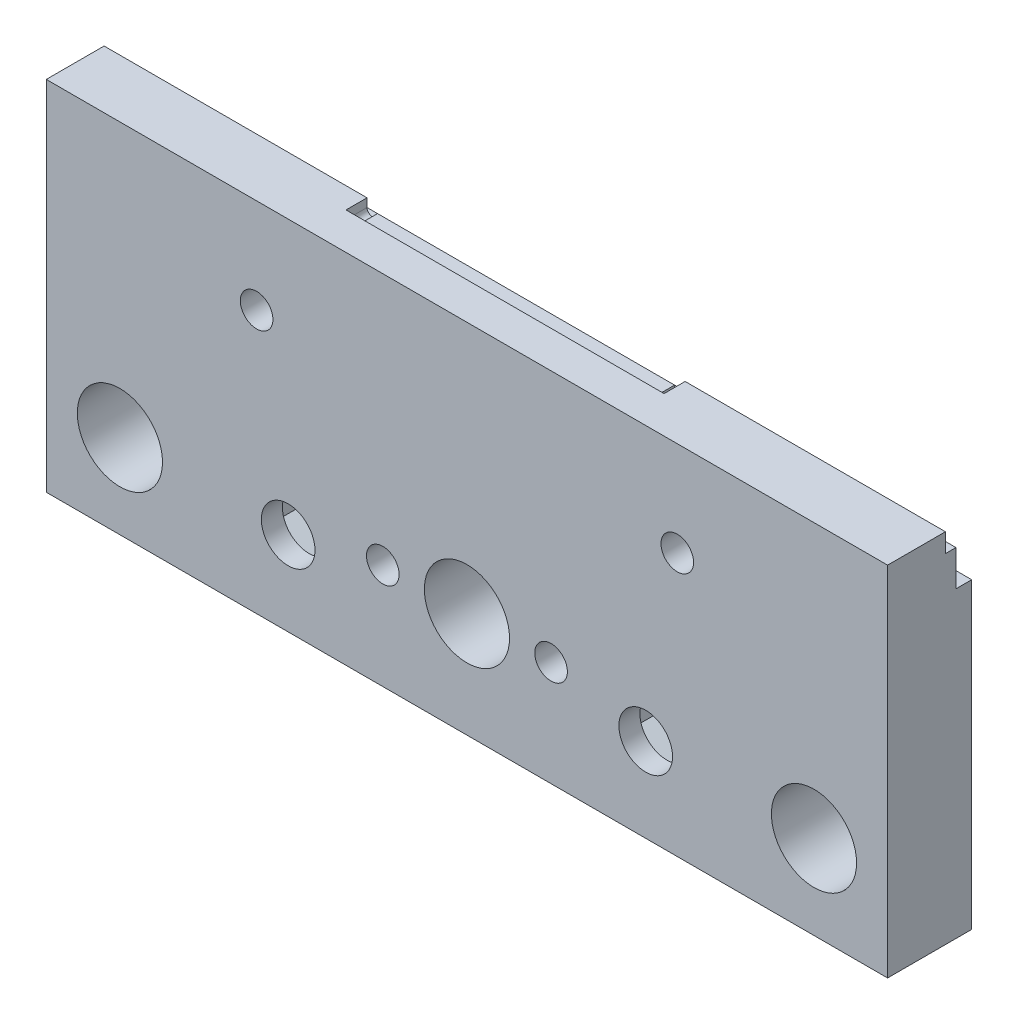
ISO-10303-21;
HEADER;
FILE_DESCRIPTION(('STEP AP214'),'2;1');
FILE_NAME('part.step','',(''),(''),'','','');
FILE_SCHEMA(('AUTOMOTIVE_DESIGN { 1 0 10303 214 1 1 1 1 }'));
ENDSEC;
DATA;
#1=APPLICATION_CONTEXT('core data for automotive mechanical design processes');
#2=APPLICATION_PROTOCOL_DEFINITION('international standard','automotive_design',2000,#1);
#3=PRODUCT_CONTEXT('',#1,'mechanical');
#4=PRODUCT('Part','Part','',(#3));
#5=PRODUCT_RELATED_PRODUCT_CATEGORY('part','',(#4));
#6=PRODUCT_DEFINITION_FORMATION('','',#4);
#7=PRODUCT_DEFINITION_CONTEXT('part definition',#1,'design');
#8=PRODUCT_DEFINITION('design','',#6,#7);
#9=PRODUCT_DEFINITION_SHAPE('','',#8);
#10=(LENGTH_UNIT() NAMED_UNIT(*) SI_UNIT(.MILLI.,.METRE.));
#11=(NAMED_UNIT(*) PLANE_ANGLE_UNIT() SI_UNIT($,.RADIAN.));
#12=(NAMED_UNIT(*) SI_UNIT($,.STERADIAN.) SOLID_ANGLE_UNIT());
#13=UNCERTAINTY_MEASURE_WITH_UNIT(LENGTH_MEASURE(1.E-05),#10,'distance_accuracy_value','');
#14=(GEOMETRIC_REPRESENTATION_CONTEXT(3) GLOBAL_UNCERTAINTY_ASSIGNED_CONTEXT((#13)) GLOBAL_UNIT_ASSIGNED_CONTEXT((#10,
#11,#12)) REPRESENTATION_CONTEXT('',''));
#15=CARTESIAN_POINT('',(0.,0.,0.));
#16=DIRECTION('',(0.,0.,1.));
#17=DIRECTION('',(1.,0.,0.));
#18=AXIS2_PLACEMENT_3D('',#15,#16,#17);
#19=CARTESIAN_POINT('',(57.,8.,0.));
#20=DIRECTION('',(0.,0.,1.));
#21=DIRECTION('',(1.,0.,0.));
#22=AXIS2_PLACEMENT_3D('',#19,#20,#21);
#23=CYLINDRICAL_SURFACE('',#22,2.55);
#24=CARTESIAN_POINT('',(57.,8.,8.));
#25=DIRECTION('',(0.,0.,1.));
#26=DIRECTION('',(1.,0.,0.));
#27=AXIS2_PLACEMENT_3D('',#24,#25,#26);
#28=CIRCLE('',#27,2.55);
#29=CARTESIAN_POINT('',(59.55,8.,8.));
#30=VERTEX_POINT('',#29);
#31=EDGE_CURVE('E570',#30,#30,#28,.T.);
#32=ORIENTED_EDGE('',*,*,#31,.T.);
#33=EDGE_LOOP('',(#32));
#34=FACE_BOUND('',#33,.T.);
#35=CARTESIAN_POINT('',(57.,8.,6.));
#36=DIRECTION('',(0.,0.,-1.));
#37=DIRECTION('',(-1.,0.,0.));
#38=AXIS2_PLACEMENT_3D('',#35,#36,#37);
#39=CIRCLE('',#38,2.55);
#40=CARTESIAN_POINT('',(54.45,8.,6.));
#41=VERTEX_POINT('',#40);
#42=EDGE_CURVE('E37',#41,#41,#39,.F.);
#43=ORIENTED_EDGE('',*,*,#42,.F.);
#44=EDGE_LOOP('',(#43));
#45=FACE_BOUND('',#44,.T.);
#46=ADVANCED_FACE('F33',(#34,#45),#23,.F.);
#47=CARTESIAN_POINT('',(23.,8.,0.));
#48=DIRECTION('',(0.,0.,1.));
#49=DIRECTION('',(1.,0.,0.));
#50=AXIS2_PLACEMENT_3D('',#47,#48,#49);
#51=CYLINDRICAL_SURFACE('',#50,2.55);
#52=CARTESIAN_POINT('',(23.,8.,8.));
#53=DIRECTION('',(0.,0.,1.));
#54=DIRECTION('',(1.,0.,0.));
#55=AXIS2_PLACEMENT_3D('',#52,#53,#54);
#56=CIRCLE('',#55,2.55);
#57=CARTESIAN_POINT('',(25.55,8.,8.));
#58=VERTEX_POINT('',#57);
#59=EDGE_CURVE('E580',#58,#58,#56,.T.);
#60=ORIENTED_EDGE('',*,*,#59,.T.);
#61=EDGE_LOOP('',(#60));
#62=FACE_BOUND('',#61,.T.);
#63=CARTESIAN_POINT('',(23.,8.,6.));
#64=DIRECTION('',(0.,0.,-1.));
#65=DIRECTION('',(-1.,0.,0.));
#66=AXIS2_PLACEMENT_3D('',#63,#64,#65);
#67=CIRCLE('',#66,2.55);
#68=CARTESIAN_POINT('',(20.45,8.,6.));
#69=VERTEX_POINT('',#68);
#70=EDGE_CURVE('E329',#69,#69,#67,.F.);
#71=ORIENTED_EDGE('',*,*,#70,.F.);
#72=EDGE_LOOP('',(#71));
#73=FACE_BOUND('',#72,.T.);
#74=ADVANCED_FACE('F637',(#62,#73),#51,.F.);
#75=CARTESIAN_POINT('',(32.,10.,0.));
#76=DIRECTION('',(0.,0.,1.));
#77=DIRECTION('',(1.,0.,0.));
#78=AXIS2_PLACEMENT_3D('',#75,#76,#77);
#79=CYLINDRICAL_SURFACE('',#78,1.55);
#80=CARTESIAN_POINT('',(32.,10.,8.));
#81=DIRECTION('',(0.,0.,1.));
#82=DIRECTION('',(1.,0.,0.));
#83=AXIS2_PLACEMENT_3D('',#80,#81,#82);
#84=CIRCLE('',#83,1.55);
#85=CARTESIAN_POINT('',(33.55,10.,8.));
#86=VERTEX_POINT('',#85);
#87=EDGE_CURVE('E540',#86,#86,#84,.T.);
#88=ORIENTED_EDGE('',*,*,#87,.T.);
#89=EDGE_LOOP('',(#88));
#90=FACE_BOUND('',#89,.T.);
#91=CARTESIAN_POINT('',(32.,10.,4.5));
#92=DIRECTION('',(0.,0.,-1.));
#93=DIRECTION('',(-1.,0.,0.));
#94=AXIS2_PLACEMENT_3D('',#91,#92,#93);
#95=CIRCLE('',#94,1.55);
#96=CARTESIAN_POINT('',(30.45,10.,4.5));
#97=VERTEX_POINT('',#96);
#98=EDGE_CURVE('E543',#97,#97,#95,.F.);
#99=ORIENTED_EDGE('',*,*,#98,.F.);
#100=EDGE_LOOP('',(#99));
#101=FACE_BOUND('',#100,.T.);
#102=ADVANCED_FACE('F643',(#90,#101),#79,.F.);
#103=CARTESIAN_POINT('',(48.,10.,0.));
#104=DIRECTION('',(0.,0.,1.));
#105=DIRECTION('',(1.,0.,0.));
#106=AXIS2_PLACEMENT_3D('',#103,#104,#105);
#107=CYLINDRICAL_SURFACE('',#106,1.55);
#108=CARTESIAN_POINT('',(48.,10.,8.));
#109=DIRECTION('',(0.,0.,1.));
#110=DIRECTION('',(1.,0.,0.));
#111=AXIS2_PLACEMENT_3D('',#108,#109,#110);
#112=CIRCLE('',#111,1.55);
#113=CARTESIAN_POINT('',(49.55,10.,8.));
#114=VERTEX_POINT('',#113);
#115=EDGE_CURVE('E536',#114,#114,#112,.T.);
#116=ORIENTED_EDGE('',*,*,#115,.T.);
#117=EDGE_LOOP('',(#116));
#118=FACE_BOUND('',#117,.T.);
#119=CARTESIAN_POINT('',(48.,10.,4.5));
#120=DIRECTION('',(0.,0.,-1.));
#121=DIRECTION('',(-1.,0.,0.));
#122=AXIS2_PLACEMENT_3D('',#119,#120,#121);
#123=CIRCLE('',#122,1.55);
#124=CARTESIAN_POINT('',(46.45,10.,4.5));
#125=VERTEX_POINT('',#124);
#126=EDGE_CURVE('E479',#125,#125,#123,.F.);
#127=ORIENTED_EDGE('',*,*,#126,.F.);
#128=EDGE_LOOP('',(#127));
#129=FACE_BOUND('',#128,.T.);
#130=ADVANCED_FACE('F666',(#118,#129),#107,.F.);
#131=CARTESIAN_POINT('',(0.,0.,8.));
#132=DIRECTION('',(0.,0.,1.));
#133=DIRECTION('',(1.,0.,0.));
#134=AXIS2_PLACEMENT_3D('',#131,#132,#133);
#135=PLANE('',#134);
#136=CARTESIAN_POINT('',(60.,25.,8.));
#137=DIRECTION('',(0.,0.,-1.));
#138=DIRECTION('',(-1.,0.,0.));
#139=AXIS2_PLACEMENT_3D('',#136,#137,#138);
#140=CIRCLE('',#139,1.55000000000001);
#141=CARTESIAN_POINT('',(58.45,25.,8.));
#142=VERTEX_POINT('',#141);
#143=EDGE_CURVE('E428',#142,#142,#140,.T.);
#144=ORIENTED_EDGE('',*,*,#143,.T.);
#145=EDGE_LOOP('',(#144));
#146=FACE_BOUND('',#145,.T.);
#147=CARTESIAN_POINT('',(20.,25.,8.));
#148=DIRECTION('',(0.,0.,-1.));
#149=DIRECTION('',(-1.,0.,0.));
#150=AXIS2_PLACEMENT_3D('',#147,#148,#149);
#151=CIRCLE('',#150,1.55);
#152=CARTESIAN_POINT('',(18.45,25.,8.));
#153=VERTEX_POINT('',#152);
#154=EDGE_CURVE('E435',#153,#153,#151,.T.);
#155=ORIENTED_EDGE('',*,*,#154,.T.);
#156=EDGE_LOOP('',(#155));
#157=FACE_BOUND('',#156,.T.);
#158=ORIENTED_EDGE('',*,*,#115,.F.);
#159=EDGE_LOOP('',(#158));
#160=FACE_BOUND('',#159,.T.);
#161=ORIENTED_EDGE('',*,*,#87,.F.);
#162=EDGE_LOOP('',(#161));
#163=FACE_BOUND('',#162,.T.);
#164=ORIENTED_EDGE('',*,*,#59,.F.);
#165=EDGE_LOOP('',(#164));
#166=FACE_BOUND('',#165,.T.);
#167=ORIENTED_EDGE('',*,*,#31,.F.);
#168=EDGE_LOOP('',(#167));
#169=FACE_BOUND('',#168,.T.);
#170=CARTESIAN_POINT('',(40.,10.,8.));
#171=DIRECTION('',(0.,0.,1.));
#172=DIRECTION('',(1.,0.,0.));
#173=AXIS2_PLACEMENT_3D('',#170,#171,#172);
#174=CIRCLE('',#173,4.05);
#175=CARTESIAN_POINT('',(44.05,10.,8.));
#176=VERTEX_POINT('',#175);
#177=EDGE_CURVE('E592',#176,#176,#174,.T.);
#178=ORIENTED_EDGE('',*,*,#177,.F.);
#179=EDGE_LOOP('',(#178));
#180=FACE_BOUND('',#179,.T.);
#181=DIRECTION('',(0.,-1.,0.));
#182=VECTOR('',#181,1.);
#183=CARTESIAN_POINT('',(0.,34.,8.));
#184=LINE('',#183,#182);
#185=CARTESIAN_POINT('',(0.,34.,8.));
#186=VERTEX_POINT('',#185);
#187=CARTESIAN_POINT('',(0.,0.,8.));
#188=VERTEX_POINT('',#187);
#189=EDGE_CURVE('E604',#186,#188,#184,.T.);
#190=ORIENTED_EDGE('',*,*,#189,.T.);
#191=DIRECTION('',(1.,0.,0.));
#192=VECTOR('',#191,1.);
#193=CARTESIAN_POINT('',(0.,0.,8.));
#194=LINE('',#193,#192);
#195=CARTESIAN_POINT('',(80.,0.,8.));
#196=VERTEX_POINT('',#195);
#197=EDGE_CURVE('E607',#188,#196,#194,.T.);
#198=ORIENTED_EDGE('',*,*,#197,.T.);
#199=DIRECTION('',(0.,1.,0.));
#200=VECTOR('',#199,1.);
#201=CARTESIAN_POINT('',(80.,0.,8.));
#202=LINE('',#201,#200);
#203=CARTESIAN_POINT('',(80.,34.,8.));
#204=VERTEX_POINT('',#203);
#205=EDGE_CURVE('E610',#196,#204,#202,.T.);
#206=ORIENTED_EDGE('',*,*,#205,.T.);
#207=DIRECTION('',(-1.,0.,0.));
#208=VECTOR('',#207,1.);
#209=CARTESIAN_POINT('',(80.,34.,8.));
#210=LINE('',#209,#208);
#211=EDGE_CURVE('E612',#204,#186,#210,.T.);
#212=ORIENTED_EDGE('',*,*,#211,.T.);
#213=EDGE_LOOP('',(#190,#198,#206,#212));
#214=FACE_BOUND('',#213,.T.);
#215=CARTESIAN_POINT('',(7.,8.,8.));
#216=DIRECTION('',(0.,0.,1.));
#217=DIRECTION('',(1.,0.,0.));
#218=AXIS2_PLACEMENT_3D('',#215,#216,#217);
#219=CIRCLE('',#218,4.05);
#220=CARTESIAN_POINT('',(11.05,8.,8.));
#221=VERTEX_POINT('',#220);
#222=EDGE_CURVE('E598',#221,#221,#219,.T.);
#223=ORIENTED_EDGE('',*,*,#222,.F.);
#224=EDGE_LOOP('',(#223));
#225=FACE_BOUND('',#224,.T.);
#226=CARTESIAN_POINT('',(73.,8.,8.));
#227=DIRECTION('',(0.,0.,1.));
#228=DIRECTION('',(1.,0.,0.));
#229=AXIS2_PLACEMENT_3D('',#226,#227,#228);
#230=CIRCLE('',#229,4.05);
#231=CARTESIAN_POINT('',(77.05,8.,8.));
#232=VERTEX_POINT('',#231);
#233=EDGE_CURVE('E586',#232,#232,#230,.T.);
#234=ORIENTED_EDGE('',*,*,#233,.F.);
#235=EDGE_LOOP('',(#234));
#236=FACE_BOUND('',#235,.T.);
#237=ADVANCED_FACE('F662',(#146,#157,#160,#163,#166,#169,#180,#214,#225,#236),#135,.T.);
#238=CARTESIAN_POINT('',(0.,0.,0.));
#239=DIRECTION('',(0.,0.,1.));
#240=DIRECTION('',(1.,0.,0.));
#241=AXIS2_PLACEMENT_3D('',#238,#239,#240);
#242=PLANE('',#241);
#243=DIRECTION('',(0.,1.,0.));
#244=VECTOR('',#243,1.);
#245=CARTESIAN_POINT('',(52.9,5.63286389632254,0.));
#246=LINE('',#245,#244);
#247=CARTESIAN_POINT('',(52.9,5.63286389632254,0.));
#248=VERTEX_POINT('',#247);
#249=CARTESIAN_POINT('',(52.9,10.3671361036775,0.));
#250=VERTEX_POINT('',#249);
#251=EDGE_CURVE('E316',#248,#250,#246,.T.);
#252=ORIENTED_EDGE('',*,*,#251,.F.);
#253=DIRECTION('',(-0.866025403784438,0.5,0.));
#254=VECTOR('',#253,1.);
#255=CARTESIAN_POINT('',(57.,3.26572779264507,0.));
#256=LINE('',#255,#254);
#257=CARTESIAN_POINT('',(57.,3.26572779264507,0.));
#258=VERTEX_POINT('',#257);
#259=EDGE_CURVE('E50',#258,#248,#256,.T.);
#260=ORIENTED_EDGE('',*,*,#259,.F.);
#261=DIRECTION('',(-0.866025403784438,-0.5,0.));
#262=VECTOR('',#261,1.);
#263=CARTESIAN_POINT('',(61.1,5.63286389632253,0.));
#264=LINE('',#263,#262);
#265=CARTESIAN_POINT('',(61.1,5.63286389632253,0.));
#266=VERTEX_POINT('',#265);
#267=EDGE_CURVE('E302',#266,#258,#264,.T.);
#268=ORIENTED_EDGE('',*,*,#267,.F.);
#269=DIRECTION('',(0.,-1.,0.));
#270=VECTOR('',#269,1.);
#271=CARTESIAN_POINT('',(61.1,10.3671361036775,0.));
#272=LINE('',#271,#270);
#273=CARTESIAN_POINT('',(61.1,10.3671361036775,0.));
#274=VERTEX_POINT('',#273);
#275=EDGE_CURVE('E305',#274,#266,#272,.T.);
#276=ORIENTED_EDGE('',*,*,#275,.F.);
#277=DIRECTION('',(0.866025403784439,-0.5,0.));
#278=VECTOR('',#277,1.);
#279=CARTESIAN_POINT('',(57.,12.7342722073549,0.));
#280=LINE('',#279,#278);
#281=CARTESIAN_POINT('',(57.,12.7342722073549,0.));
#282=VERTEX_POINT('',#281);
#283=EDGE_CURVE('E322',#282,#274,#280,.T.);
#284=ORIENTED_EDGE('',*,*,#283,.F.);
#285=DIRECTION('',(0.866025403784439,0.5,0.));
#286=VECTOR('',#285,1.);
#287=CARTESIAN_POINT('',(52.9,10.3671361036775,0.));
#288=LINE('',#287,#286);
#289=EDGE_CURVE('E319',#250,#282,#288,.T.);
#290=ORIENTED_EDGE('',*,*,#289,.F.);
#291=EDGE_LOOP('',(#252,#260,#268,#276,#284,#290));
#292=FACE_BOUND('',#291,.T.);
#293=DIRECTION('',(0.,1.,0.));
#294=VECTOR('',#293,1.);
#295=CARTESIAN_POINT('',(18.9,5.63286389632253,0.));
#296=LINE('',#295,#294);
#297=CARTESIAN_POINT('',(18.9,5.63286389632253,0.));
#298=VERTEX_POINT('',#297);
#299=CARTESIAN_POINT('',(18.9,10.3671361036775,0.));
#300=VERTEX_POINT('',#299);
#301=EDGE_CURVE('E358',#298,#300,#296,.T.);
#302=ORIENTED_EDGE('',*,*,#301,.F.);
#303=DIRECTION('',(-0.866025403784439,0.499999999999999,0.));
#304=VECTOR('',#303,1.);
#305=CARTESIAN_POINT('',(23.,3.26572779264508,0.));
#306=LINE('',#305,#304);
#307=CARTESIAN_POINT('',(23.,3.26572779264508,0.));
#308=VERTEX_POINT('',#307);
#309=EDGE_CURVE('E58',#308,#298,#306,.T.);
#310=ORIENTED_EDGE('',*,*,#309,.F.);
#311=DIRECTION('',(-0.866025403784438,-0.5,0.));
#312=VECTOR('',#311,1.);
#313=CARTESIAN_POINT('',(27.1,5.63286389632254,0.));
#314=LINE('',#313,#312);
#315=CARTESIAN_POINT('',(27.1,5.63286389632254,0.));
#316=VERTEX_POINT('',#315);
#317=EDGE_CURVE('E341',#316,#308,#314,.T.);
#318=ORIENTED_EDGE('',*,*,#317,.F.);
#319=DIRECTION('',(0.,-1.,0.));
#320=VECTOR('',#319,1.);
#321=CARTESIAN_POINT('',(27.1,10.3671361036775,0.));
#322=LINE('',#321,#320);
#323=CARTESIAN_POINT('',(27.1,10.3671361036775,0.));
#324=VERTEX_POINT('',#323);
#325=EDGE_CURVE('E367',#324,#316,#322,.T.);
#326=ORIENTED_EDGE('',*,*,#325,.F.);
#327=DIRECTION('',(0.866025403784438,-0.5,0.));
#328=VECTOR('',#327,1.);
#329=CARTESIAN_POINT('',(23.,12.7342722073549,0.));
#330=LINE('',#329,#328);
#331=CARTESIAN_POINT('',(23.,12.7342722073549,0.));
#332=VERTEX_POINT('',#331);
#333=EDGE_CURVE('E364',#332,#324,#330,.T.);
#334=ORIENTED_EDGE('',*,*,#333,.F.);
#335=DIRECTION('',(0.866025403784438,0.500000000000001,0.));
#336=VECTOR('',#335,1.);
#337=CARTESIAN_POINT('',(18.9,10.3671361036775,0.));
#338=LINE('',#337,#336);
#339=EDGE_CURVE('E361',#300,#332,#338,.T.);
#340=ORIENTED_EDGE('',*,*,#339,.F.);
#341=EDGE_LOOP('',(#302,#310,#318,#326,#334,#340));
#342=FACE_BOUND('',#341,.T.);
#343=CARTESIAN_POINT('',(60.,25.,0.));
#344=DIRECTION('',(0.,0.,-1.));
#345=DIRECTION('',(-1.,0.,0.));
#346=AXIS2_PLACEMENT_3D('',#343,#344,#345);
#347=CIRCLE('',#346,1.55000000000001);
#348=CARTESIAN_POINT('',(58.45,25.,0.));
#349=VERTEX_POINT('',#348);
#350=EDGE_CURVE('E432',#349,#349,#347,.T.);
#351=ORIENTED_EDGE('',*,*,#350,.F.);
#352=EDGE_LOOP('',(#351));
#353=FACE_BOUND('',#352,.T.);
#354=CARTESIAN_POINT('',(20.,25.,0.));
#355=DIRECTION('',(0.,0.,-1.));
#356=DIRECTION('',(-1.,0.,0.));
#357=AXIS2_PLACEMENT_3D('',#354,#355,#356);
#358=CIRCLE('',#357,1.55);
#359=CARTESIAN_POINT('',(18.45,25.,0.));
#360=VERTEX_POINT('',#359);
#361=EDGE_CURVE('E417',#360,#360,#358,.T.);
#362=ORIENTED_EDGE('',*,*,#361,.F.);
#363=EDGE_LOOP('',(#362));
#364=FACE_BOUND('',#363,.T.);
#365=DIRECTION('',(0.,1.,0.));
#366=VECTOR('',#365,1.);
#367=CARTESIAN_POINT('',(45.15,8.35455173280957,0.));
#368=LINE('',#367,#366);
#369=CARTESIAN_POINT('',(45.15,8.35455173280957,0.));
#370=VERTEX_POINT('',#369);
#371=CARTESIAN_POINT('',(45.15,11.6454482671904,0.));
#372=VERTEX_POINT('',#371);
#373=EDGE_CURVE('E462',#370,#372,#368,.T.);
#374=ORIENTED_EDGE('',*,*,#373,.F.);
#375=DIRECTION('',(-0.866025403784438,0.5,0.));
#376=VECTOR('',#375,1.);
#377=CARTESIAN_POINT('',(48.,6.70910346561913,0.));
#378=LINE('',#377,#376);
#379=CARTESIAN_POINT('',(48.,6.70910346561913,0.));
#380=VERTEX_POINT('',#379);
#381=EDGE_CURVE('E460',#380,#370,#378,.T.);
#382=ORIENTED_EDGE('',*,*,#381,.F.);
#383=DIRECTION('',(-0.866025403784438,-0.5,0.));
#384=VECTOR('',#383,1.);
#385=CARTESIAN_POINT('',(50.85,8.35455173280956,0.));
#386=LINE('',#385,#384);
#387=CARTESIAN_POINT('',(50.85,8.35455173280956,0.));
#388=VERTEX_POINT('',#387);
#389=EDGE_CURVE('E444',#388,#380,#386,.T.);
#390=ORIENTED_EDGE('',*,*,#389,.F.);
#391=DIRECTION('',(0.,-1.,0.));
#392=VECTOR('',#391,1.);
#393=CARTESIAN_POINT('',(50.85,11.6454482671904,0.));
#394=LINE('',#393,#392);
#395=CARTESIAN_POINT('',(50.85,11.6454482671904,0.));
#396=VERTEX_POINT('',#395);
#397=EDGE_CURVE('E472',#396,#388,#394,.T.);
#398=ORIENTED_EDGE('',*,*,#397,.F.);
#399=DIRECTION('',(0.866025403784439,-0.5,0.));
#400=VECTOR('',#399,1.);
#401=CARTESIAN_POINT('',(48.,13.2908965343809,0.));
#402=LINE('',#401,#400);
#403=CARTESIAN_POINT('',(48.,13.2908965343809,0.));
#404=VERTEX_POINT('',#403);
#405=EDGE_CURVE('E469',#404,#396,#402,.T.);
#406=ORIENTED_EDGE('',*,*,#405,.F.);
#407=DIRECTION('',(0.866025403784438,0.5,0.));
#408=VECTOR('',#407,1.);
#409=CARTESIAN_POINT('',(45.15,11.6454482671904,0.));
#410=LINE('',#409,#408);
#411=EDGE_CURVE('E466',#372,#404,#410,.T.);
#412=ORIENTED_EDGE('',*,*,#411,.F.);
#413=EDGE_LOOP('',(#374,#382,#390,#398,#406,#412));
#414=FACE_BOUND('',#413,.T.);
#415=DIRECTION('',(0.,1.,0.));
#416=VECTOR('',#415,1.);
#417=CARTESIAN_POINT('',(29.15,8.35455173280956,0.));
#418=LINE('',#417,#416);
#419=CARTESIAN_POINT('',(29.15,8.35455173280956,0.));
#420=VERTEX_POINT('',#419);
#421=CARTESIAN_POINT('',(29.15,11.6454482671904,0.));
#422=VERTEX_POINT('',#421);
#423=EDGE_CURVE('E511',#420,#422,#418,.T.);
#424=ORIENTED_EDGE('',*,*,#423,.F.);
#425=DIRECTION('',(-0.866025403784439,0.499999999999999,0.));
#426=VECTOR('',#425,1.);
#427=CARTESIAN_POINT('',(32.,6.70910346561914,0.));
#428=LINE('',#427,#426);
#429=CARTESIAN_POINT('',(32.,6.70910346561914,0.));
#430=VERTEX_POINT('',#429);
#431=EDGE_CURVE('E431',#430,#420,#428,.T.);
#432=ORIENTED_EDGE('',*,*,#431,.F.);
#433=DIRECTION('',(-0.866025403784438,-0.500000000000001,0.));
#434=VECTOR('',#433,1.);
#435=CARTESIAN_POINT('',(34.85,8.35455173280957,0.));
#436=LINE('',#435,#434);
#437=CARTESIAN_POINT('',(34.85,8.35455173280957,0.));
#438=VERTEX_POINT('',#437);
#439=EDGE_CURVE('E494',#438,#430,#436,.T.);
#440=ORIENTED_EDGE('',*,*,#439,.F.);
#441=DIRECTION('',(0.,-1.,0.));
#442=VECTOR('',#441,1.);
#443=CARTESIAN_POINT('',(34.85,11.6454482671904,0.));
#444=LINE('',#443,#442);
#445=CARTESIAN_POINT('',(34.85,11.6454482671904,0.));
#446=VERTEX_POINT('',#445);
#447=EDGE_CURVE('E520',#446,#438,#444,.T.);
#448=ORIENTED_EDGE('',*,*,#447,.F.);
#449=DIRECTION('',(0.866025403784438,-0.500000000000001,0.));
#450=VECTOR('',#449,1.);
#451=CARTESIAN_POINT('',(32.,13.2908965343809,0.));
#452=LINE('',#451,#450);
#453=CARTESIAN_POINT('',(32.,13.2908965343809,0.));
#454=VERTEX_POINT('',#453);
#455=EDGE_CURVE('E517',#454,#446,#452,.T.);
#456=ORIENTED_EDGE('',*,*,#455,.F.);
#457=DIRECTION('',(0.866025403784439,0.5,0.));
#458=VECTOR('',#457,1.);
#459=CARTESIAN_POINT('',(29.15,11.6454482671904,0.));
#460=LINE('',#459,#458);
#461=EDGE_CURVE('E514',#422,#454,#460,.T.);
#462=ORIENTED_EDGE('',*,*,#461,.F.);
#463=EDGE_LOOP('',(#424,#432,#440,#448,#456,#462));
#464=FACE_BOUND('',#463,.T.);
#465=DIRECTION('',(0.,-1.,0.));
#466=VECTOR('',#465,1.);
#467=CARTESIAN_POINT('',(0.,34.,0.));
#468=LINE('',#467,#466);
#469=CARTESIAN_POINT('',(0.,28.7999999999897,0.));
#470=VERTEX_POINT('',#469);
#471=CARTESIAN_POINT('',(0.,0.,0.));
#472=VERTEX_POINT('',#471);
#473=EDGE_CURVE('E601',#470,#472,#468,.T.);
#474=ORIENTED_EDGE('',*,*,#473,.F.);
#475=DIRECTION('',(1.,0.,0.));
#476=VECTOR('',#475,1.);
#477=CARTESIAN_POINT('',(0.,28.7999999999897,0.));
#478=LINE('',#477,#476);
#479=CARTESIAN_POINT('',(80.,28.7999999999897,0.));
#480=VERTEX_POINT('',#479);
#481=EDGE_CURVE('E567',#470,#480,#478,.T.);
#482=ORIENTED_EDGE('',*,*,#481,.T.);
#483=DIRECTION('',(0.,1.,0.));
#484=VECTOR('',#483,1.);
#485=CARTESIAN_POINT('',(80.,0.,0.));
#486=LINE('',#485,#484);
#487=CARTESIAN_POINT('',(80.,0.,0.));
#488=VERTEX_POINT('',#487);
#489=EDGE_CURVE('E608',#488,#480,#486,.T.);
#490=ORIENTED_EDGE('',*,*,#489,.F.);
#491=DIRECTION('',(1.,0.,0.));
#492=VECTOR('',#491,1.);
#493=CARTESIAN_POINT('',(0.,0.,0.));
#494=LINE('',#493,#492);
#495=EDGE_CURVE('E616',#472,#488,#494,.T.);
#496=ORIENTED_EDGE('',*,*,#495,.F.);
#497=EDGE_LOOP('',(#474,#482,#490,#496));
#498=FACE_BOUND('',#497,.T.);
#499=CARTESIAN_POINT('',(7.,8.,0.));
#500=DIRECTION('',(0.,0.,1.));
#501=DIRECTION('',(1.,0.,0.));
#502=AXIS2_PLACEMENT_3D('',#499,#500,#501);
#503=CIRCLE('',#502,4.05);
#504=CARTESIAN_POINT('',(11.05,8.,0.));
#505=VERTEX_POINT('',#504);
#506=EDGE_CURVE('E595',#505,#505,#503,.T.);
#507=ORIENTED_EDGE('',*,*,#506,.T.);
#508=EDGE_LOOP('',(#507));
#509=FACE_BOUND('',#508,.T.);
#510=CARTESIAN_POINT('',(40.,10.,0.));
#511=DIRECTION('',(0.,0.,1.));
#512=DIRECTION('',(1.,0.,0.));
#513=AXIS2_PLACEMENT_3D('',#510,#511,#512);
#514=CIRCLE('',#513,4.05);
#515=CARTESIAN_POINT('',(44.05,10.,0.));
#516=VERTEX_POINT('',#515);
#517=EDGE_CURVE('E589',#516,#516,#514,.T.);
#518=ORIENTED_EDGE('',*,*,#517,.T.);
#519=EDGE_LOOP('',(#518));
#520=FACE_BOUND('',#519,.T.);
#521=CARTESIAN_POINT('',(73.,8.,0.));
#522=DIRECTION('',(0.,0.,1.));
#523=DIRECTION('',(1.,0.,0.));
#524=AXIS2_PLACEMENT_3D('',#521,#522,#523);
#525=CIRCLE('',#524,4.05);
#526=CARTESIAN_POINT('',(77.05,8.,0.));
#527=VERTEX_POINT('',#526);
#528=EDGE_CURVE('E583',#527,#527,#525,.T.);
#529=ORIENTED_EDGE('',*,*,#528,.T.);
#530=EDGE_LOOP('',(#529));
#531=FACE_BOUND('',#530,.T.);
#532=ADVANCED_FACE('F665',(#292,#342,#353,#364,#414,#464,#498,#509,#520,#531),#242,.F.);
#533=CARTESIAN_POINT('',(0.,34.,8.));
#534=DIRECTION('',(1.,0.,0.));
#535=DIRECTION('',(0.,0.,-1.));
#536=AXIS2_PLACEMENT_3D('',#533,#534,#535);
#537=PLANE('',#536);
#538=DIRECTION('',(0.,-1.,0.));
#539=VECTOR('',#538,1.);
#540=CARTESIAN_POINT('',(0.,32.2,1.5));
#541=LINE('',#540,#539);
#542=CARTESIAN_POINT('',(0.,32.2,1.5));
#543=VERTEX_POINT('',#542);
#544=CARTESIAN_POINT('',(0.,28.8,1.5));
#545=VERTEX_POINT('',#544);
#546=EDGE_CURVE('E551',#543,#545,#541,.T.);
#547=ORIENTED_EDGE('',*,*,#546,.T.);
#548=DIRECTION('',(0.,-6.85562717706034E-12,-1.));
#549=VECTOR('',#548,1.);
#550=CARTESIAN_POINT('',(0.,28.8,1.5));
#551=LINE('',#550,#549);
#552=EDGE_CURVE('E554',#545,#470,#551,.T.);
#553=ORIENTED_EDGE('',*,*,#552,.T.);
#554=ORIENTED_EDGE('',*,*,#473,.T.);
#555=DIRECTION('',(0.,0.,-1.));
#556=VECTOR('',#555,1.);
#557=CARTESIAN_POINT('',(0.,0.,8.));
#558=LINE('',#557,#556);
#559=EDGE_CURVE('E11',#188,#472,#558,.T.);
#560=ORIENTED_EDGE('',*,*,#559,.F.);
#561=ORIENTED_EDGE('',*,*,#189,.F.);
#562=DIRECTION('',(0.,0.,-1.));
#563=VECTOR('',#562,1.);
#564=CARTESIAN_POINT('',(0.,34.,8.));
#565=LINE('',#564,#563);
#566=CARTESIAN_POINT('',(0.,34.,2.5));
#567=VERTEX_POINT('',#566);
#568=EDGE_CURVE('E614',#186,#567,#565,.T.);
#569=ORIENTED_EDGE('',*,*,#568,.T.);
#570=DIRECTION('',(0.,-1.,0.));
#571=VECTOR('',#570,1.);
#572=CARTESIAN_POINT('',(0.,32.2,2.5));
#573=LINE('',#572,#571);
#574=CARTESIAN_POINT('',(0.,32.2,2.5));
#575=VERTEX_POINT('',#574);
#576=EDGE_CURVE('E544',#567,#575,#573,.T.);
#577=ORIENTED_EDGE('',*,*,#576,.T.);
#578=DIRECTION('',(0.,0.,-1.));
#579=VECTOR('',#578,1.);
#580=CARTESIAN_POINT('',(0.,32.2,1.5));
#581=LINE('',#580,#579);
#582=EDGE_CURVE('E547',#575,#543,#581,.T.);
#583=ORIENTED_EDGE('',*,*,#582,.T.);
#584=EDGE_LOOP('',(#547,#553,#554,#560,#561,#569,#577,#583));
#585=FACE_BOUND('',#584,.T.);
#586=ADVANCED_FACE('F35',(#585),#537,.F.);
#587=CARTESIAN_POINT('',(0.,0.,8.));
#588=DIRECTION('',(0.,1.,0.));
#589=DIRECTION('',(0.,0.,1.));
#590=AXIS2_PLACEMENT_3D('',#587,#588,#589);
#591=PLANE('',#590);
#592=ORIENTED_EDGE('',*,*,#495,.T.);
#593=DIRECTION('',(0.,0.,-1.));
#594=VECTOR('',#593,1.);
#595=CARTESIAN_POINT('',(80.,0.,8.));
#596=LINE('',#595,#594);
#597=EDGE_CURVE('E42',#196,#488,#596,.T.);
#598=ORIENTED_EDGE('',*,*,#597,.F.);
#599=ORIENTED_EDGE('',*,*,#197,.F.);
#600=ORIENTED_EDGE('',*,*,#559,.T.);
#601=EDGE_LOOP('',(#592,#598,#599,#600));
#602=FACE_BOUND('',#601,.T.);
#603=ADVANCED_FACE('F676',(#602),#591,.F.);
#604=CARTESIAN_POINT('',(80.,0.,8.));
#605=DIRECTION('',(-1.,0.,0.));
#606=DIRECTION('',(0.,0.,1.));
#607=AXIS2_PLACEMENT_3D('',#604,#605,#606);
#608=PLANE('',#607);
#609=ORIENTED_EDGE('',*,*,#489,.T.);
#610=DIRECTION('',(0.,-6.85562717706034E-12,-1.));
#611=VECTOR('',#610,1.);
#612=CARTESIAN_POINT('',(80.,28.8,1.5));
#613=LINE('',#612,#611);
#614=CARTESIAN_POINT('',(80.,28.8,1.5));
#615=VERTEX_POINT('',#614);
#616=EDGE_CURVE('E548',#615,#480,#613,.T.);
#617=ORIENTED_EDGE('',*,*,#616,.F.);
#618=DIRECTION('',(0.,-1.,0.));
#619=VECTOR('',#618,1.);
#620=CARTESIAN_POINT('',(80.,32.2,1.5));
#621=LINE('',#620,#619);
#622=CARTESIAN_POINT('',(80.,32.2,1.5));
#623=VERTEX_POINT('',#622);
#624=EDGE_CURVE('E563',#623,#615,#621,.T.);
#625=ORIENTED_EDGE('',*,*,#624,.F.);
#626=DIRECTION('',(0.,0.,-1.));
#627=VECTOR('',#626,1.);
#628=CARTESIAN_POINT('',(80.,32.2,1.5));
#629=LINE('',#628,#627);
#630=CARTESIAN_POINT('',(80.,32.2,2.5));
#631=VERTEX_POINT('',#630);
#632=EDGE_CURVE('E560',#631,#623,#629,.T.);
#633=ORIENTED_EDGE('',*,*,#632,.F.);
#634=DIRECTION('',(0.,-1.,0.));
#635=VECTOR('',#634,1.);
#636=CARTESIAN_POINT('',(80.,32.2,2.5));
#637=LINE('',#636,#635);
#638=CARTESIAN_POINT('',(80.,34.,2.5));
#639=VERTEX_POINT('',#638);
#640=EDGE_CURVE('E539',#639,#631,#637,.T.);
#641=ORIENTED_EDGE('',*,*,#640,.F.);
#642=DIRECTION('',(0.,0.,-1.));
#643=VECTOR('',#642,1.);
#644=CARTESIAN_POINT('',(80.,34.,8.));
#645=LINE('',#644,#643);
#646=EDGE_CURVE('E622',#204,#639,#645,.T.);
#647=ORIENTED_EDGE('',*,*,#646,.F.);
#648=ORIENTED_EDGE('',*,*,#205,.F.);
#649=ORIENTED_EDGE('',*,*,#597,.T.);
#650=EDGE_LOOP('',(#609,#617,#625,#633,#641,#647,#648,#649));
#651=FACE_BOUND('',#650,.T.);
#652=ADVANCED_FACE('F673',(#651),#608,.F.);
#653=CARTESIAN_POINT('',(80.,34.,8.));
#654=DIRECTION('',(0.,-1.,0.));
#655=DIRECTION('',(1.,0.,0.));
#656=AXIS2_PLACEMENT_3D('',#653,#654,#655);
#657=PLANE('',#656);
#658=DIRECTION('',(1.,0.,0.));
#659=VECTOR('',#658,1.);
#660=CARTESIAN_POINT('',(25.000000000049,34.,4.49999999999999));
#661=LINE('',#660,#659);
#662=CARTESIAN_POINT('',(25.000000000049,34.,4.49999999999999));
#663=VERTEX_POINT('',#662);
#664=CARTESIAN_POINT('',(55.247938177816,34.,4.49999999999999));
#665=VERTEX_POINT('',#664);
#666=EDGE_CURVE('E385',#663,#665,#661,.T.);
#667=ORIENTED_EDGE('',*,*,#666,.F.);
#668=DIRECTION('',(0.,0.,-1.));
#669=VECTOR('',#668,1.);
#670=CARTESIAN_POINT('',(25.000000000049,34.,4.49999999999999));
#671=LINE('',#670,#669);
#672=CARTESIAN_POINT('',(25.000000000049,34.,2.49999999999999));
#673=VERTEX_POINT('',#672);
#674=EDGE_CURVE('E401',#663,#673,#671,.T.);
#675=ORIENTED_EDGE('',*,*,#674,.T.);
#676=DIRECTION('',(1.,0.,0.));
#677=VECTOR('',#676,1.);
#678=CARTESIAN_POINT('',(0.,34.,2.5));
#679=LINE('',#678,#677);
#680=EDGE_CURVE('E577',#567,#673,#679,.T.);
#681=ORIENTED_EDGE('',*,*,#680,.F.);
#682=ORIENTED_EDGE('',*,*,#568,.F.);
#683=ORIENTED_EDGE('',*,*,#211,.F.);
#684=ORIENTED_EDGE('',*,*,#646,.T.);
#685=CARTESIAN_POINT('',(55.247938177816,34.,2.5));
#686=VERTEX_POINT('',#685);
#687=EDGE_CURVE('E557',#686,#639,#679,.T.);
#688=ORIENTED_EDGE('',*,*,#687,.F.);
#689=DIRECTION('',(0.,0.,-1.));
#690=VECTOR('',#689,1.);
#691=CARTESIAN_POINT('',(55.247938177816,34.,4.49999999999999));
#692=LINE('',#691,#690);
#693=EDGE_CURVE('E424',#665,#686,#692,.T.);
#694=ORIENTED_EDGE('',*,*,#693,.F.);
#695=EDGE_LOOP('',(#667,#675,#681,#682,#683,#684,#688,#694));
#696=FACE_BOUND('',#695,.T.);
#697=ADVANCED_FACE('F660',(#696),#657,.F.);
#698=CARTESIAN_POINT('',(7.,8.,8.));
#699=DIRECTION('',(0.,0.,-1.));
#700=DIRECTION('',(-1.,0.,0.));
#701=AXIS2_PLACEMENT_3D('',#698,#699,#700);
#702=CYLINDRICAL_SURFACE('',#701,4.05);
#703=ORIENTED_EDGE('',*,*,#222,.T.);
#704=EDGE_LOOP('',(#703));
#705=FACE_BOUND('',#704,.T.);
#706=ORIENTED_EDGE('',*,*,#506,.F.);
#707=EDGE_LOOP('',(#706));
#708=FACE_BOUND('',#707,.T.);
#709=ADVANCED_FACE('F656',(#705,#708),#702,.F.);
#710=CARTESIAN_POINT('',(40.,10.,8.));
#711=DIRECTION('',(0.,0.,-1.));
#712=DIRECTION('',(-1.,0.,0.));
#713=AXIS2_PLACEMENT_3D('',#710,#711,#712);
#714=CYLINDRICAL_SURFACE('',#713,4.05);
#715=ORIENTED_EDGE('',*,*,#177,.T.);
#716=EDGE_LOOP('',(#715));
#717=FACE_BOUND('',#716,.T.);
#718=ORIENTED_EDGE('',*,*,#517,.F.);
#719=EDGE_LOOP('',(#718));
#720=FACE_BOUND('',#719,.T.);
#721=ADVANCED_FACE('F652',(#717,#720),#714,.F.);
#722=CARTESIAN_POINT('',(73.,8.,8.));
#723=DIRECTION('',(0.,0.,-1.));
#724=DIRECTION('',(-1.,0.,0.));
#725=AXIS2_PLACEMENT_3D('',#722,#723,#724);
#726=CYLINDRICAL_SURFACE('',#725,4.05);
#727=ORIENTED_EDGE('',*,*,#233,.T.);
#728=EDGE_LOOP('',(#727));
#729=FACE_BOUND('',#728,.T.);
#730=ORIENTED_EDGE('',*,*,#528,.F.);
#731=EDGE_LOOP('',(#730));
#732=FACE_BOUND('',#731,.T.);
#733=ADVANCED_FACE('F648',(#729,#732),#726,.F.);
#734=CARTESIAN_POINT('',(0.,28.8,1.5));
#735=DIRECTION('',(0.,-1.,6.85562717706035E-12));
#736=DIRECTION('',(0.,-6.85562717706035E-12,-1.));
#737=AXIS2_PLACEMENT_3D('',#734,#735,#736);
#738=PLANE('',#737);
#739=ORIENTED_EDGE('',*,*,#616,.T.);
#740=ORIENTED_EDGE('',*,*,#481,.F.);
#741=ORIENTED_EDGE('',*,*,#552,.F.);
#742=DIRECTION('',(1.,0.,0.));
#743=VECTOR('',#742,1.);
#744=CARTESIAN_POINT('',(0.,28.8,1.5));
#745=LINE('',#744,#743);
#746=EDGE_CURVE('E571',#545,#615,#745,.T.);
#747=ORIENTED_EDGE('',*,*,#746,.T.);
#748=EDGE_LOOP('',(#739,#740,#741,#747));
#749=FACE_BOUND('',#748,.T.);
#750=ADVANCED_FACE('F651',(#749),#738,.F.);
#751=CARTESIAN_POINT('',(0.,32.2,1.5));
#752=DIRECTION('',(0.,0.,1.));
#753=DIRECTION('',(0.,-1.,0.));
#754=AXIS2_PLACEMENT_3D('',#751,#752,#753);
#755=PLANE('',#754);
#756=ORIENTED_EDGE('',*,*,#624,.T.);
#757=ORIENTED_EDGE('',*,*,#746,.F.);
#758=ORIENTED_EDGE('',*,*,#546,.F.);
#759=DIRECTION('',(1.,0.,0.));
#760=VECTOR('',#759,1.);
#761=CARTESIAN_POINT('',(0.,32.2,1.5));
#762=LINE('',#761,#760);
#763=EDGE_CURVE('E573',#543,#623,#762,.T.);
#764=ORIENTED_EDGE('',*,*,#763,.T.);
#765=EDGE_LOOP('',(#756,#757,#758,#764));
#766=FACE_BOUND('',#765,.T.);
#767=ADVANCED_FACE('F699',(#766),#755,.F.);
#768=CARTESIAN_POINT('',(0.,32.2,1.5));
#769=DIRECTION('',(0.,-1.,0.));
#770=DIRECTION('',(0.,0.,-1.));
#771=AXIS2_PLACEMENT_3D('',#768,#769,#770);
#772=PLANE('',#771);
#773=ORIENTED_EDGE('',*,*,#632,.T.);
#774=ORIENTED_EDGE('',*,*,#763,.F.);
#775=ORIENTED_EDGE('',*,*,#582,.F.);
#776=DIRECTION('',(1.,0.,0.));
#777=VECTOR('',#776,1.);
#778=CARTESIAN_POINT('',(0.,32.2,2.5));
#779=LINE('',#778,#777);
#780=EDGE_CURVE('E575',#575,#631,#779,.T.);
#781=ORIENTED_EDGE('',*,*,#780,.T.);
#782=EDGE_LOOP('',(#773,#774,#775,#781));
#783=FACE_BOUND('',#782,.T.);
#784=ADVANCED_FACE('F704',(#783),#772,.F.);
#785=CARTESIAN_POINT('',(0.,32.2,2.5));
#786=DIRECTION('',(0.,0.,1.));
#787=DIRECTION('',(0.,-1.,0.));
#788=AXIS2_PLACEMENT_3D('',#785,#786,#787);
#789=PLANE('',#788);
#790=ORIENTED_EDGE('',*,*,#680,.T.);
#791=DIRECTION('',(0.,1.,0.));
#792=VECTOR('',#791,1.);
#793=CARTESIAN_POINT('',(25.000000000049,34.,2.49999999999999));
#794=LINE('',#793,#792);
#795=CARTESIAN_POINT('',(25.000000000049,33.2,2.49999999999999));
#796=VERTEX_POINT('',#795);
#797=EDGE_CURVE('E402',#796,#673,#794,.T.);
#798=ORIENTED_EDGE('',*,*,#797,.F.);
#799=CARTESIAN_POINT('',(25.500000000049,33.2,2.49999999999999));
#800=DIRECTION('',(0.,0.,-1.));
#801=DIRECTION('',(-1.,0.,0.));
#802=AXIS2_PLACEMENT_3D('',#799,#800,#801);
#803=CIRCLE('',#802,0.500000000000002);
#804=CARTESIAN_POINT('',(26.000000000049,33.2,2.49999999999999));
#805=VERTEX_POINT('',#804);
#806=EDGE_CURVE('E386',#805,#796,#803,.T.);
#807=ORIENTED_EDGE('',*,*,#806,.F.);
#808=DIRECTION('',(-1.,0.,0.));
#809=VECTOR('',#808,1.);
#810=CARTESIAN_POINT('',(26.000000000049,33.2,2.49999999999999));
#811=LINE('',#810,#809);
#812=CARTESIAN_POINT('',(54.247938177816,33.2,2.49999999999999));
#813=VERTEX_POINT('',#812);
#814=EDGE_CURVE('E410',#813,#805,#811,.T.);
#815=ORIENTED_EDGE('',*,*,#814,.F.);
#816=CARTESIAN_POINT('',(54.747938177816,33.2,2.49999999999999));
#817=DIRECTION('',(0.,0.,-1.));
#818=DIRECTION('',(-1.,0.,0.));
#819=AXIS2_PLACEMENT_3D('',#816,#817,#818);
#820=CIRCLE('',#819,0.5);
#821=CARTESIAN_POINT('',(55.247938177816,33.2,2.49999999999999));
#822=VERTEX_POINT('',#821);
#823=EDGE_CURVE('E407',#822,#813,#820,.T.);
#824=ORIENTED_EDGE('',*,*,#823,.F.);
#825=DIRECTION('',(0.,-1.,0.));
#826=VECTOR('',#825,1.);
#827=CARTESIAN_POINT('',(55.247938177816,34.,2.49999999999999));
#828=LINE('',#827,#826);
#829=EDGE_CURVE('E404',#686,#822,#828,.T.);
#830=ORIENTED_EDGE('',*,*,#829,.F.);
#831=ORIENTED_EDGE('',*,*,#687,.T.);
#832=ORIENTED_EDGE('',*,*,#640,.T.);
#833=ORIENTED_EDGE('',*,*,#780,.F.);
#834=ORIENTED_EDGE('',*,*,#576,.F.);
#835=EDGE_LOOP('',(#790,#798,#807,#815,#824,#830,#831,#832,#833,#834));
#836=FACE_BOUND('',#835,.T.);
#837=ADVANCED_FACE('F706',(#836),#789,.F.);
#838=CARTESIAN_POINT('',(0.,0.,4.5));
#839=DIRECTION('',(0.,0.,-1.));
#840=DIRECTION('',(-1.,0.,0.));
#841=AXIS2_PLACEMENT_3D('',#838,#839,#840);
#842=PLANE('',#841);
#843=DIRECTION('',(-0.866025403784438,0.5,0.));
#844=VECTOR('',#843,1.);
#845=CARTESIAN_POINT('',(48.,6.70910346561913,4.5));
#846=LINE('',#845,#844);
#847=CARTESIAN_POINT('',(48.,6.70910346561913,4.5));
#848=VERTEX_POINT('',#847);
#849=CARTESIAN_POINT('',(45.15,8.35455173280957,4.5));
#850=VERTEX_POINT('',#849);
#851=EDGE_CURVE('E440',#848,#850,#846,.T.);
#852=ORIENTED_EDGE('',*,*,#851,.T.);
#853=DIRECTION('',(0.,1.,0.));
#854=VECTOR('',#853,1.);
#855=CARTESIAN_POINT('',(45.15,8.35455173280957,4.5));
#856=LINE('',#855,#854);
#857=CARTESIAN_POINT('',(45.15,11.6454482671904,4.5));
#858=VERTEX_POINT('',#857);
#859=EDGE_CURVE('E443',#850,#858,#856,.T.);
#860=ORIENTED_EDGE('',*,*,#859,.T.);
#861=DIRECTION('',(0.866025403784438,0.5,0.));
#862=VECTOR('',#861,1.);
#863=CARTESIAN_POINT('',(45.15,11.6454482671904,4.5));
#864=LINE('',#863,#862);
#865=CARTESIAN_POINT('',(48.,13.2908965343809,4.5));
#866=VERTEX_POINT('',#865);
#867=EDGE_CURVE('E447',#858,#866,#864,.T.);
#868=ORIENTED_EDGE('',*,*,#867,.T.);
#869=DIRECTION('',(0.866025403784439,-0.5,0.));
#870=VECTOR('',#869,1.);
#871=CARTESIAN_POINT('',(48.,13.2908965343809,4.5));
#872=LINE('',#871,#870);
#873=CARTESIAN_POINT('',(50.85,11.6454482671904,4.5));
#874=VERTEX_POINT('',#873);
#875=EDGE_CURVE('E450',#866,#874,#872,.T.);
#876=ORIENTED_EDGE('',*,*,#875,.T.);
#877=DIRECTION('',(0.,-1.,0.));
#878=VECTOR('',#877,1.);
#879=CARTESIAN_POINT('',(50.85,11.6454482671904,4.5));
#880=LINE('',#879,#878);
#881=CARTESIAN_POINT('',(50.85,8.35455173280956,4.5));
#882=VERTEX_POINT('',#881);
#883=EDGE_CURVE('E453',#874,#882,#880,.T.);
#884=ORIENTED_EDGE('',*,*,#883,.T.);
#885=DIRECTION('',(-0.866025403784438,-0.5,0.));
#886=VECTOR('',#885,1.);
#887=CARTESIAN_POINT('',(50.85,8.35455173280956,4.5));
#888=LINE('',#887,#886);
#889=EDGE_CURVE('E456',#882,#848,#888,.T.);
#890=ORIENTED_EDGE('',*,*,#889,.T.);
#891=EDGE_LOOP('',(#852,#860,#868,#876,#884,#890));
#892=FACE_BOUND('',#891,.T.);
#893=ORIENTED_EDGE('',*,*,#126,.T.);
#894=EDGE_LOOP('',(#893));
#895=FACE_BOUND('',#894,.T.);
#896=ADVANCED_FACE('F759',(#892,#895),#842,.T.);
#897=CARTESIAN_POINT('',(48.,6.70910346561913,4.5));
#898=DIRECTION('',(-0.5,-0.866025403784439,0.));
#899=DIRECTION('',(0.866025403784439,-0.5,0.));
#900=AXIS2_PLACEMENT_3D('',#897,#898,#899);
#901=PLANE('',#900);
#902=ORIENTED_EDGE('',*,*,#381,.T.);
#903=DIRECTION('',(0.,0.,-1.));
#904=VECTOR('',#903,1.);
#905=CARTESIAN_POINT('',(45.15,8.35455173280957,4.5));
#906=LINE('',#905,#904);
#907=EDGE_CURVE('E459',#850,#370,#906,.T.);
#908=ORIENTED_EDGE('',*,*,#907,.F.);
#909=ORIENTED_EDGE('',*,*,#851,.F.);
#910=DIRECTION('',(0.,0.,-1.));
#911=VECTOR('',#910,1.);
#912=CARTESIAN_POINT('',(48.,6.70910346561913,4.5));
#913=LINE('',#912,#911);
#914=EDGE_CURVE('E477',#848,#380,#913,.T.);
#915=ORIENTED_EDGE('',*,*,#914,.T.);
#916=EDGE_LOOP('',(#902,#908,#909,#915));
#917=FACE_BOUND('',#916,.T.);
#918=ADVANCED_FACE('F762',(#917),#901,.F.);
#919=CARTESIAN_POINT('',(50.85,8.35455173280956,4.5));
#920=DIRECTION('',(0.5,-0.866025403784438,0.));
#921=DIRECTION('',(0.866025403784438,0.5,0.));
#922=AXIS2_PLACEMENT_3D('',#919,#920,#921);
#923=PLANE('',#922);
#924=ORIENTED_EDGE('',*,*,#389,.T.);
#925=ORIENTED_EDGE('',*,*,#914,.F.);
#926=ORIENTED_EDGE('',*,*,#889,.F.);
#927=DIRECTION('',(0.,0.,-1.));
#928=VECTOR('',#927,1.);
#929=CARTESIAN_POINT('',(50.85,8.35455173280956,4.5));
#930=LINE('',#929,#928);
#931=EDGE_CURVE('E480',#882,#388,#930,.T.);
#932=ORIENTED_EDGE('',*,*,#931,.T.);
#933=EDGE_LOOP('',(#924,#925,#926,#932));
#934=FACE_BOUND('',#933,.T.);
#935=ADVANCED_FACE('F764',(#934),#923,.F.);
#936=CARTESIAN_POINT('',(50.85,11.6454482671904,4.5));
#937=DIRECTION('',(1.,0.,0.));
#938=DIRECTION('',(0.,0.,-1.));
#939=AXIS2_PLACEMENT_3D('',#936,#937,#938);
#940=PLANE('',#939);
#941=ORIENTED_EDGE('',*,*,#397,.T.);
#942=ORIENTED_EDGE('',*,*,#931,.F.);
#943=ORIENTED_EDGE('',*,*,#883,.F.);
#944=DIRECTION('',(0.,0.,-1.));
#945=VECTOR('',#944,1.);
#946=CARTESIAN_POINT('',(50.85,11.6454482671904,4.5));
#947=LINE('',#946,#945);
#948=EDGE_CURVE('E482',#874,#396,#947,.T.);
#949=ORIENTED_EDGE('',*,*,#948,.T.);
#950=EDGE_LOOP('',(#941,#942,#943,#949));
#951=FACE_BOUND('',#950,.T.);
#952=ADVANCED_FACE('F767',(#951),#940,.F.);
#953=CARTESIAN_POINT('',(48.,13.2908965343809,4.5));
#954=DIRECTION('',(0.5,0.866025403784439,0.));
#955=DIRECTION('',(-0.866025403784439,0.5,0.));
#956=AXIS2_PLACEMENT_3D('',#953,#954,#955);
#957=PLANE('',#956);
#958=ORIENTED_EDGE('',*,*,#405,.T.);
#959=ORIENTED_EDGE('',*,*,#948,.F.);
#960=ORIENTED_EDGE('',*,*,#875,.F.);
#961=DIRECTION('',(0.,0.,-1.));
#962=VECTOR('',#961,1.);
#963=CARTESIAN_POINT('',(48.,13.2908965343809,4.5));
#964=LINE('',#963,#962);
#965=EDGE_CURVE('E484',#866,#404,#964,.T.);
#966=ORIENTED_EDGE('',*,*,#965,.T.);
#967=EDGE_LOOP('',(#958,#959,#960,#966));
#968=FACE_BOUND('',#967,.T.);
#969=ADVANCED_FACE('F771',(#968),#957,.F.);
#970=CARTESIAN_POINT('',(45.15,11.6454482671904,4.5));
#971=DIRECTION('',(-0.5,0.866025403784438,0.));
#972=DIRECTION('',(-0.866025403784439,-0.5,0.));
#973=AXIS2_PLACEMENT_3D('',#970,#971,#972);
#974=PLANE('',#973);
#975=ORIENTED_EDGE('',*,*,#411,.T.);
#976=ORIENTED_EDGE('',*,*,#965,.F.);
#977=ORIENTED_EDGE('',*,*,#867,.F.);
#978=DIRECTION('',(0.,0.,-1.));
#979=VECTOR('',#978,1.);
#980=CARTESIAN_POINT('',(45.15,11.6454482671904,4.5));
#981=LINE('',#980,#979);
#982=EDGE_CURVE('E486',#858,#372,#981,.T.);
#983=ORIENTED_EDGE('',*,*,#982,.T.);
#984=EDGE_LOOP('',(#975,#976,#977,#983));
#985=FACE_BOUND('',#984,.T.);
#986=ADVANCED_FACE('F775',(#985),#974,.F.);
#987=CARTESIAN_POINT('',(45.15,8.35455173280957,4.5));
#988=DIRECTION('',(-1.,0.,0.));
#989=DIRECTION('',(0.,0.,1.));
#990=AXIS2_PLACEMENT_3D('',#987,#988,#989);
#991=PLANE('',#990);
#992=ORIENTED_EDGE('',*,*,#373,.T.);
#993=ORIENTED_EDGE('',*,*,#982,.F.);
#994=ORIENTED_EDGE('',*,*,#859,.F.);
#995=ORIENTED_EDGE('',*,*,#907,.T.);
#996=EDGE_LOOP('',(#992,#993,#994,#995));
#997=FACE_BOUND('',#996,.T.);
#998=ADVANCED_FACE('F779',(#997),#991,.F.);
#999=CARTESIAN_POINT('',(0.,0.,4.5));
#1000=DIRECTION('',(0.,0.,-1.));
#1001=DIRECTION('',(-1.,0.,0.));
#1002=AXIS2_PLACEMENT_3D('',#999,#1000,#1001);
#1003=PLANE('',#1002);
#1004=DIRECTION('',(-0.866025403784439,0.499999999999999,0.));
#1005=VECTOR('',#1004,1.);
#1006=CARTESIAN_POINT('',(32.,6.70910346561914,4.5));
#1007=LINE('',#1006,#1005);
#1008=CARTESIAN_POINT('',(32.,6.70910346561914,4.5));
#1009=VERTEX_POINT('',#1008);
#1010=CARTESIAN_POINT('',(29.15,8.35455173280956,4.5));
#1011=VERTEX_POINT('',#1010);
#1012=EDGE_CURVE('E490',#1009,#1011,#1007,.T.);
#1013=ORIENTED_EDGE('',*,*,#1012,.T.);
#1014=DIRECTION('',(0.,1.,0.));
#1015=VECTOR('',#1014,1.);
#1016=CARTESIAN_POINT('',(29.15,8.35455173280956,4.5));
#1017=LINE('',#1016,#1015);
#1018=CARTESIAN_POINT('',(29.15,11.6454482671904,4.5));
#1019=VERTEX_POINT('',#1018);
#1020=EDGE_CURVE('E493',#1011,#1019,#1017,.T.);
#1021=ORIENTED_EDGE('',*,*,#1020,.T.);
#1022=DIRECTION('',(0.866025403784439,0.5,0.));
#1023=VECTOR('',#1022,1.);
#1024=CARTESIAN_POINT('',(29.15,11.6454482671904,4.5));
#1025=LINE('',#1024,#1023);
#1026=CARTESIAN_POINT('',(32.,13.2908965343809,4.5));
#1027=VERTEX_POINT('',#1026);
#1028=EDGE_CURVE('E497',#1019,#1027,#1025,.T.);
#1029=ORIENTED_EDGE('',*,*,#1028,.T.);
#1030=DIRECTION('',(0.866025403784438,-0.500000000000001,0.));
#1031=VECTOR('',#1030,1.);
#1032=CARTESIAN_POINT('',(32.,13.2908965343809,4.5));
#1033=LINE('',#1032,#1031);
#1034=CARTESIAN_POINT('',(34.85,11.6454482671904,4.5));
#1035=VERTEX_POINT('',#1034);
#1036=EDGE_CURVE('E500',#1027,#1035,#1033,.T.);
#1037=ORIENTED_EDGE('',*,*,#1036,.T.);
#1038=DIRECTION('',(0.,-1.,0.));
#1039=VECTOR('',#1038,1.);
#1040=CARTESIAN_POINT('',(34.85,11.6454482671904,4.5));
#1041=LINE('',#1040,#1039);
#1042=CARTESIAN_POINT('',(34.85,8.35455173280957,4.5));
#1043=VERTEX_POINT('',#1042);
#1044=EDGE_CURVE('E503',#1035,#1043,#1041,.T.);
#1045=ORIENTED_EDGE('',*,*,#1044,.T.);
#1046=DIRECTION('',(-0.866025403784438,-0.500000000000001,0.));
#1047=VECTOR('',#1046,1.);
#1048=CARTESIAN_POINT('',(34.85,8.35455173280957,4.5));
#1049=LINE('',#1048,#1047);
#1050=EDGE_CURVE('E506',#1043,#1009,#1049,.T.);
#1051=ORIENTED_EDGE('',*,*,#1050,.T.);
#1052=EDGE_LOOP('',(#1013,#1021,#1029,#1037,#1045,#1051));
#1053=FACE_BOUND('',#1052,.T.);
#1054=ORIENTED_EDGE('',*,*,#98,.T.);
#1055=EDGE_LOOP('',(#1054));
#1056=FACE_BOUND('',#1055,.T.);
#1057=ADVANCED_FACE('F783',(#1053,#1056),#1003,.T.);
#1058=CARTESIAN_POINT('',(32.,6.70910346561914,4.5));
#1059=DIRECTION('',(-0.499999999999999,-0.866025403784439,0.));
#1060=DIRECTION('',(0.866025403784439,-0.499999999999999,0.));
#1061=AXIS2_PLACEMENT_3D('',#1058,#1059,#1060);
#1062=PLANE('',#1061);
#1063=ORIENTED_EDGE('',*,*,#431,.T.);
#1064=DIRECTION('',(0.,0.,-1.));
#1065=VECTOR('',#1064,1.);
#1066=CARTESIAN_POINT('',(29.15,8.35455173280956,4.5));
#1067=LINE('',#1066,#1065);
#1068=EDGE_CURVE('E509',#1011,#420,#1067,.T.);
#1069=ORIENTED_EDGE('',*,*,#1068,.F.);
#1070=ORIENTED_EDGE('',*,*,#1012,.F.);
#1071=DIRECTION('',(0.,0.,-1.));
#1072=VECTOR('',#1071,1.);
#1073=CARTESIAN_POINT('',(32.,6.70910346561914,4.5));
#1074=LINE('',#1073,#1072);
#1075=EDGE_CURVE('E463',#1009,#430,#1074,.T.);
#1076=ORIENTED_EDGE('',*,*,#1075,.T.);
#1077=EDGE_LOOP('',(#1063,#1069,#1070,#1076));
#1078=FACE_BOUND('',#1077,.T.);
#1079=ADVANCED_FACE('F790',(#1078),#1062,.F.);
#1080=CARTESIAN_POINT('',(34.85,8.35455173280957,4.5));
#1081=DIRECTION('',(0.500000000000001,-0.866025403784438,0.));
#1082=DIRECTION('',(0.866025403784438,0.500000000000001,0.));
#1083=AXIS2_PLACEMENT_3D('',#1080,#1081,#1082);
#1084=PLANE('',#1083);
#1085=ORIENTED_EDGE('',*,*,#439,.T.);
#1086=ORIENTED_EDGE('',*,*,#1075,.F.);
#1087=ORIENTED_EDGE('',*,*,#1050,.F.);
#1088=DIRECTION('',(0.,0.,-1.));
#1089=VECTOR('',#1088,1.);
#1090=CARTESIAN_POINT('',(34.85,8.35455173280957,4.5));
#1091=LINE('',#1090,#1089);
#1092=EDGE_CURVE('E526',#1043,#438,#1091,.T.);
#1093=ORIENTED_EDGE('',*,*,#1092,.T.);
#1094=EDGE_LOOP('',(#1085,#1086,#1087,#1093));
#1095=FACE_BOUND('',#1094,.T.);
#1096=ADVANCED_FACE('F792',(#1095),#1084,.F.);
#1097=CARTESIAN_POINT('',(34.85,11.6454482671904,4.5));
#1098=DIRECTION('',(1.,0.,0.));
#1099=DIRECTION('',(0.,1.,0.));
#1100=AXIS2_PLACEMENT_3D('',#1097,#1098,#1099);
#1101=PLANE('',#1100);
#1102=ORIENTED_EDGE('',*,*,#447,.T.);
#1103=ORIENTED_EDGE('',*,*,#1092,.F.);
#1104=ORIENTED_EDGE('',*,*,#1044,.F.);
#1105=DIRECTION('',(0.,0.,-1.));
#1106=VECTOR('',#1105,1.);
#1107=CARTESIAN_POINT('',(34.85,11.6454482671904,4.5));
#1108=LINE('',#1107,#1106);
#1109=EDGE_CURVE('E528',#1035,#446,#1108,.T.);
#1110=ORIENTED_EDGE('',*,*,#1109,.T.);
#1111=EDGE_LOOP('',(#1102,#1103,#1104,#1110));
#1112=FACE_BOUND('',#1111,.T.);
#1113=ADVANCED_FACE('F795',(#1112),#1101,.F.);
#1114=CARTESIAN_POINT('',(32.,13.2908965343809,4.5));
#1115=DIRECTION('',(0.500000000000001,0.866025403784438,0.));
#1116=DIRECTION('',(-0.866025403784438,0.500000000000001,0.));
#1117=AXIS2_PLACEMENT_3D('',#1114,#1115,#1116);
#1118=PLANE('',#1117);
#1119=ORIENTED_EDGE('',*,*,#455,.T.);
#1120=ORIENTED_EDGE('',*,*,#1109,.F.);
#1121=ORIENTED_EDGE('',*,*,#1036,.F.);
#1122=DIRECTION('',(0.,0.,-1.));
#1123=VECTOR('',#1122,1.);
#1124=CARTESIAN_POINT('',(32.,13.2908965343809,4.5));
#1125=LINE('',#1124,#1123);
#1126=EDGE_CURVE('E530',#1027,#454,#1125,.T.);
#1127=ORIENTED_EDGE('',*,*,#1126,.T.);
#1128=EDGE_LOOP('',(#1119,#1120,#1121,#1127));
#1129=FACE_BOUND('',#1128,.T.);
#1130=ADVANCED_FACE('F799',(#1129),#1118,.F.);
#1131=CARTESIAN_POINT('',(29.15,11.6454482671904,4.5));
#1132=DIRECTION('',(-0.5,0.866025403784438,0.));
#1133=DIRECTION('',(-0.866025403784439,-0.5,0.));
#1134=AXIS2_PLACEMENT_3D('',#1131,#1132,#1133);
#1135=PLANE('',#1134);
#1136=ORIENTED_EDGE('',*,*,#461,.T.);
#1137=ORIENTED_EDGE('',*,*,#1126,.F.);
#1138=ORIENTED_EDGE('',*,*,#1028,.F.);
#1139=DIRECTION('',(0.,0.,-1.));
#1140=VECTOR('',#1139,1.);
#1141=CARTESIAN_POINT('',(29.15,11.6454482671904,4.5));
#1142=LINE('',#1141,#1140);
#1143=EDGE_CURVE('E532',#1019,#422,#1142,.T.);
#1144=ORIENTED_EDGE('',*,*,#1143,.T.);
#1145=EDGE_LOOP('',(#1136,#1137,#1138,#1144));
#1146=FACE_BOUND('',#1145,.T.);
#1147=ADVANCED_FACE('F803',(#1146),#1135,.F.);
#1148=CARTESIAN_POINT('',(29.15,8.35455173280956,4.5));
#1149=DIRECTION('',(-1.,0.,0.));
#1150=DIRECTION('',(0.,-1.,0.));
#1151=AXIS2_PLACEMENT_3D('',#1148,#1149,#1150);
#1152=PLANE('',#1151);
#1153=ORIENTED_EDGE('',*,*,#423,.T.);
#1154=ORIENTED_EDGE('',*,*,#1143,.F.);
#1155=ORIENTED_EDGE('',*,*,#1020,.F.);
#1156=ORIENTED_EDGE('',*,*,#1068,.T.);
#1157=EDGE_LOOP('',(#1153,#1154,#1155,#1156));
#1158=FACE_BOUND('',#1157,.T.);
#1159=ADVANCED_FACE('F757',(#1158),#1152,.F.);
#1160=CARTESIAN_POINT('',(20.,25.,8.));
#1161=DIRECTION('',(0.,0.,-1.));
#1162=DIRECTION('',(-1.,0.,0.));
#1163=AXIS2_PLACEMENT_3D('',#1160,#1161,#1162);
#1164=CYLINDRICAL_SURFACE('',#1163,1.55);
#1165=ORIENTED_EDGE('',*,*,#154,.F.);
#1166=EDGE_LOOP('',(#1165));
#1167=FACE_BOUND('',#1166,.T.);
#1168=ORIENTED_EDGE('',*,*,#361,.T.);
#1169=EDGE_LOOP('',(#1168));
#1170=FACE_BOUND('',#1169,.T.);
#1171=ADVANCED_FACE('F753',(#1167,#1170),#1164,.F.);
#1172=CARTESIAN_POINT('',(60.,25.,8.));
#1173=DIRECTION('',(0.,0.,-1.));
#1174=DIRECTION('',(-1.,0.,0.));
#1175=AXIS2_PLACEMENT_3D('',#1172,#1173,#1174);
#1176=CYLINDRICAL_SURFACE('',#1175,1.55000000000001);
#1177=ORIENTED_EDGE('',*,*,#143,.F.);
#1178=EDGE_LOOP('',(#1177));
#1179=FACE_BOUND('',#1178,.T.);
#1180=ORIENTED_EDGE('',*,*,#350,.T.);
#1181=EDGE_LOOP('',(#1180));
#1182=FACE_BOUND('',#1181,.T.);
#1183=ADVANCED_FACE('F750',(#1179,#1182),#1176,.F.);
#1184=CARTESIAN_POINT('',(25.000000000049,34.,4.49999999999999));
#1185=DIRECTION('',(-1.,0.,0.));
#1186=DIRECTION('',(0.,-1.,0.));
#1187=AXIS2_PLACEMENT_3D('',#1184,#1185,#1186);
#1188=PLANE('',#1187);
#1189=ORIENTED_EDGE('',*,*,#797,.T.);
#1190=ORIENTED_EDGE('',*,*,#674,.F.);
#1191=DIRECTION('',(0.,1.,0.));
#1192=VECTOR('',#1191,1.);
#1193=CARTESIAN_POINT('',(25.000000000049,34.,4.49999999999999));
#1194=LINE('',#1193,#1192);
#1195=CARTESIAN_POINT('',(25.000000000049,33.2,4.49999999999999));
#1196=VERTEX_POINT('',#1195);
#1197=EDGE_CURVE('E382',#1196,#663,#1194,.T.);
#1198=ORIENTED_EDGE('',*,*,#1197,.F.);
#1199=DIRECTION('',(0.,0.,-1.));
#1200=VECTOR('',#1199,1.);
#1201=CARTESIAN_POINT('',(25.000000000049,33.2,4.49999999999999));
#1202=LINE('',#1201,#1200);
#1203=EDGE_CURVE('E415',#1196,#796,#1202,.T.);
#1204=ORIENTED_EDGE('',*,*,#1203,.T.);
#1205=EDGE_LOOP('',(#1189,#1190,#1198,#1204));
#1206=FACE_BOUND('',#1205,.T.);
#1207=ADVANCED_FACE('F721',(#1206),#1188,.F.);
#1208=CARTESIAN_POINT('',(25.500000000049,33.2,4.49999999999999));
#1209=DIRECTION('',(0.,0.,-1.));
#1210=DIRECTION('',(-1.,0.,0.));
#1211=AXIS2_PLACEMENT_3D('',#1208,#1209,#1210);
#1212=CYLINDRICAL_SURFACE('',#1211,0.500000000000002);
#1213=ORIENTED_EDGE('',*,*,#806,.T.);
#1214=ORIENTED_EDGE('',*,*,#1203,.F.);
#1215=CARTESIAN_POINT('',(25.500000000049,33.2,4.49999999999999));
#1216=DIRECTION('',(0.,0.,-1.));
#1217=DIRECTION('',(-1.,0.,0.));
#1218=AXIS2_PLACEMENT_3D('',#1215,#1216,#1217);
#1219=CIRCLE('',#1218,0.500000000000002);
#1220=CARTESIAN_POINT('',(26.000000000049,33.2,4.49999999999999));
#1221=VERTEX_POINT('',#1220);
#1222=EDGE_CURVE('E398',#1221,#1196,#1219,.T.);
#1223=ORIENTED_EDGE('',*,*,#1222,.F.);
#1224=DIRECTION('',(0.,0.,-1.));
#1225=VECTOR('',#1224,1.);
#1226=CARTESIAN_POINT('',(26.000000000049,33.2,4.49999999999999));
#1227=LINE('',#1226,#1225);
#1228=EDGE_CURVE('E418',#1221,#805,#1227,.T.);
#1229=ORIENTED_EDGE('',*,*,#1228,.T.);
#1230=EDGE_LOOP('',(#1213,#1214,#1223,#1229));
#1231=FACE_BOUND('',#1230,.T.);
#1232=ADVANCED_FACE('F727',(#1231),#1212,.F.);
#1233=CARTESIAN_POINT('',(26.000000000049,33.2,4.49999999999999));
#1234=DIRECTION('',(0.,-1.,0.));
#1235=DIRECTION('',(1.,0.,0.));
#1236=AXIS2_PLACEMENT_3D('',#1233,#1234,#1235);
#1237=PLANE('',#1236);
#1238=ORIENTED_EDGE('',*,*,#814,.T.);
#1239=ORIENTED_EDGE('',*,*,#1228,.F.);
#1240=DIRECTION('',(-1.,0.,0.));
#1241=VECTOR('',#1240,1.);
#1242=CARTESIAN_POINT('',(26.000000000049,33.2,4.49999999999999));
#1243=LINE('',#1242,#1241);
#1244=CARTESIAN_POINT('',(54.247938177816,33.2,4.49999999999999));
#1245=VERTEX_POINT('',#1244);
#1246=EDGE_CURVE('E395',#1245,#1221,#1243,.T.);
#1247=ORIENTED_EDGE('',*,*,#1246,.F.);
#1248=DIRECTION('',(0.,0.,-1.));
#1249=VECTOR('',#1248,1.);
#1250=CARTESIAN_POINT('',(54.247938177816,33.2,4.49999999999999));
#1251=LINE('',#1250,#1249);
#1252=EDGE_CURVE('E420',#1245,#813,#1251,.T.);
#1253=ORIENTED_EDGE('',*,*,#1252,.T.);
#1254=EDGE_LOOP('',(#1238,#1239,#1247,#1253));
#1255=FACE_BOUND('',#1254,.T.);
#1256=ADVANCED_FACE('F731',(#1255),#1237,.F.);
#1257=CARTESIAN_POINT('',(54.747938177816,33.2,4.49999999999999));
#1258=DIRECTION('',(0.,0.,-1.));
#1259=DIRECTION('',(-1.,0.,0.));
#1260=AXIS2_PLACEMENT_3D('',#1257,#1258,#1259);
#1261=CYLINDRICAL_SURFACE('',#1260,0.5);
#1262=ORIENTED_EDGE('',*,*,#823,.T.);
#1263=ORIENTED_EDGE('',*,*,#1252,.F.);
#1264=CARTESIAN_POINT('',(54.747938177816,33.2,4.49999999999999));
#1265=DIRECTION('',(0.,0.,-1.));
#1266=DIRECTION('',(-1.,0.,0.));
#1267=AXIS2_PLACEMENT_3D('',#1264,#1265,#1266);
#1268=CIRCLE('',#1267,0.5);
#1269=CARTESIAN_POINT('',(55.247938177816,33.2,4.49999999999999));
#1270=VERTEX_POINT('',#1269);
#1271=EDGE_CURVE('E392',#1270,#1245,#1268,.T.);
#1272=ORIENTED_EDGE('',*,*,#1271,.F.);
#1273=DIRECTION('',(0.,0.,-1.));
#1274=VECTOR('',#1273,1.);
#1275=CARTESIAN_POINT('',(55.247938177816,33.2,4.49999999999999));
#1276=LINE('',#1275,#1274);
#1277=EDGE_CURVE('E422',#1270,#822,#1276,.T.);
#1278=ORIENTED_EDGE('',*,*,#1277,.T.);
#1279=EDGE_LOOP('',(#1262,#1263,#1272,#1278));
#1280=FACE_BOUND('',#1279,.T.);
#1281=ADVANCED_FACE('F734',(#1280),#1261,.F.);
#1282=CARTESIAN_POINT('',(55.247938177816,34.,4.49999999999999));
#1283=DIRECTION('',(1.,0.,0.));
#1284=DIRECTION('',(0.,0.,-1.));
#1285=AXIS2_PLACEMENT_3D('',#1282,#1283,#1284);
#1286=PLANE('',#1285);
#1287=ORIENTED_EDGE('',*,*,#829,.T.);
#1288=ORIENTED_EDGE('',*,*,#1277,.F.);
#1289=DIRECTION('',(0.,-1.,0.));
#1290=VECTOR('',#1289,1.);
#1291=CARTESIAN_POINT('',(55.247938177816,34.,4.49999999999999));
#1292=LINE('',#1291,#1290);
#1293=EDGE_CURVE('E389',#665,#1270,#1292,.T.);
#1294=ORIENTED_EDGE('',*,*,#1293,.F.);
#1295=ORIENTED_EDGE('',*,*,#693,.T.);
#1296=EDGE_LOOP('',(#1287,#1288,#1294,#1295));
#1297=FACE_BOUND('',#1296,.T.);
#1298=ADVANCED_FACE('F736',(#1297),#1286,.F.);
#1299=CARTESIAN_POINT('',(25.500000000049,33.2,4.49999999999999));
#1300=DIRECTION('',(0.,0.,-1.));
#1301=DIRECTION('',(-1.,0.,0.));
#1302=AXIS2_PLACEMENT_3D('',#1299,#1300,#1301);
#1303=PLANE('',#1302);
#1304=ORIENTED_EDGE('',*,*,#1197,.T.);
#1305=ORIENTED_EDGE('',*,*,#666,.T.);
#1306=ORIENTED_EDGE('',*,*,#1293,.T.);
#1307=ORIENTED_EDGE('',*,*,#1271,.T.);
#1308=ORIENTED_EDGE('',*,*,#1246,.T.);
#1309=ORIENTED_EDGE('',*,*,#1222,.T.);
#1310=EDGE_LOOP('',(#1304,#1305,#1306,#1307,#1308,#1309));
#1311=FACE_BOUND('',#1310,.T.);
#1312=ADVANCED_FACE('F723',(#1311),#1303,.T.);
#1313=CARTESIAN_POINT('',(0.,0.,6.));
#1314=DIRECTION('',(0.,0.,-1.));
#1315=DIRECTION('',(-1.,0.,0.));
#1316=AXIS2_PLACEMENT_3D('',#1313,#1314,#1315);
#1317=PLANE('',#1316);
#1318=DIRECTION('',(-0.866025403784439,0.499999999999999,0.));
#1319=VECTOR('',#1318,1.);
#1320=CARTESIAN_POINT('',(23.,3.26572779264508,6.));
#1321=LINE('',#1320,#1319);
#1322=CARTESIAN_POINT('',(23.,3.26572779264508,6.));
#1323=VERTEX_POINT('',#1322);
#1324=CARTESIAN_POINT('',(18.9,5.63286389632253,6.));
#1325=VERTEX_POINT('',#1324);
#1326=EDGE_CURVE('E337',#1323,#1325,#1321,.T.);
#1327=ORIENTED_EDGE('',*,*,#1326,.T.);
#1328=DIRECTION('',(0.,1.,0.));
#1329=VECTOR('',#1328,1.);
#1330=CARTESIAN_POINT('',(18.9,5.63286389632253,6.));
#1331=LINE('',#1330,#1329);
#1332=CARTESIAN_POINT('',(18.9,10.3671361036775,6.));
#1333=VERTEX_POINT('',#1332);
#1334=EDGE_CURVE('E340',#1325,#1333,#1331,.T.);
#1335=ORIENTED_EDGE('',*,*,#1334,.T.);
#1336=DIRECTION('',(0.866025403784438,0.500000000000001,0.));
#1337=VECTOR('',#1336,1.);
#1338=CARTESIAN_POINT('',(18.9,10.3671361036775,6.));
#1339=LINE('',#1338,#1337);
#1340=CARTESIAN_POINT('',(23.,12.7342722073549,6.));
#1341=VERTEX_POINT('',#1340);
#1342=EDGE_CURVE('E344',#1333,#1341,#1339,.T.);
#1343=ORIENTED_EDGE('',*,*,#1342,.T.);
#1344=DIRECTION('',(0.866025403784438,-0.5,0.));
#1345=VECTOR('',#1344,1.);
#1346=CARTESIAN_POINT('',(23.,12.7342722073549,6.));
#1347=LINE('',#1346,#1345);
#1348=CARTESIAN_POINT('',(27.1,10.3671361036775,6.));
#1349=VERTEX_POINT('',#1348);
#1350=EDGE_CURVE('E347',#1341,#1349,#1347,.T.);
#1351=ORIENTED_EDGE('',*,*,#1350,.T.);
#1352=DIRECTION('',(0.,-1.,0.));
#1353=VECTOR('',#1352,1.);
#1354=CARTESIAN_POINT('',(27.1,10.3671361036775,6.));
#1355=LINE('',#1354,#1353);
#1356=CARTESIAN_POINT('',(27.1,5.63286389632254,6.));
#1357=VERTEX_POINT('',#1356);
#1358=EDGE_CURVE('E350',#1349,#1357,#1355,.T.);
#1359=ORIENTED_EDGE('',*,*,#1358,.T.);
#1360=DIRECTION('',(-0.866025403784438,-0.5,0.));
#1361=VECTOR('',#1360,1.);
#1362=CARTESIAN_POINT('',(27.1,5.63286389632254,6.));
#1363=LINE('',#1362,#1361);
#1364=EDGE_CURVE('E353',#1357,#1323,#1363,.T.);
#1365=ORIENTED_EDGE('',*,*,#1364,.T.);
#1366=EDGE_LOOP('',(#1327,#1335,#1343,#1351,#1359,#1365));
#1367=FACE_BOUND('',#1366,.T.);
#1368=ORIENTED_EDGE('',*,*,#70,.T.);
#1369=EDGE_LOOP('',(#1368));
#1370=FACE_BOUND('',#1369,.T.);
#1371=ADVANCED_FACE('F743',(#1367,#1370),#1317,.T.);
#1372=CARTESIAN_POINT('',(23.,3.26572779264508,6.));
#1373=DIRECTION('',(-0.499999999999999,-0.866025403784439,0.));
#1374=DIRECTION('',(0.866025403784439,-0.499999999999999,0.));
#1375=AXIS2_PLACEMENT_3D('',#1372,#1373,#1374);
#1376=PLANE('',#1375);
#1377=ORIENTED_EDGE('',*,*,#309,.T.);
#1378=DIRECTION('',(0.,0.,-1.));
#1379=VECTOR('',#1378,1.);
#1380=CARTESIAN_POINT('',(18.9,5.63286389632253,6.));
#1381=LINE('',#1380,#1379);
#1382=EDGE_CURVE('E356',#1325,#298,#1381,.T.);
#1383=ORIENTED_EDGE('',*,*,#1382,.F.);
#1384=ORIENTED_EDGE('',*,*,#1326,.F.);
#1385=DIRECTION('',(0.,0.,-1.));
#1386=VECTOR('',#1385,1.);
#1387=CARTESIAN_POINT('',(23.,3.26572779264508,6.));
#1388=LINE('',#1387,#1386);
#1389=EDGE_CURVE('E317',#1323,#308,#1388,.T.);
#1390=ORIENTED_EDGE('',*,*,#1389,.T.);
#1391=EDGE_LOOP('',(#1377,#1383,#1384,#1390));
#1392=FACE_BOUND('',#1391,.T.);
#1393=ADVANCED_FACE('F953',(#1392),#1376,.F.);
#1394=CARTESIAN_POINT('',(27.1,5.63286389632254,6.));
#1395=DIRECTION('',(0.5,-0.866025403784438,0.));
#1396=DIRECTION('',(0.866025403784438,0.5,0.));
#1397=AXIS2_PLACEMENT_3D('',#1394,#1395,#1396);
#1398=PLANE('',#1397);
#1399=ORIENTED_EDGE('',*,*,#317,.T.);
#1400=ORIENTED_EDGE('',*,*,#1389,.F.);
#1401=ORIENTED_EDGE('',*,*,#1364,.F.);
#1402=DIRECTION('',(0.,0.,-1.));
#1403=VECTOR('',#1402,1.);
#1404=CARTESIAN_POINT('',(27.1,5.63286389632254,6.));
#1405=LINE('',#1404,#1403);
#1406=EDGE_CURVE('E373',#1357,#316,#1405,.T.);
#1407=ORIENTED_EDGE('',*,*,#1406,.T.);
#1408=EDGE_LOOP('',(#1399,#1400,#1401,#1407));
#1409=FACE_BOUND('',#1408,.T.);
#1410=ADVANCED_FACE('F963',(#1409),#1398,.F.);
#1411=CARTESIAN_POINT('',(27.1,10.3671361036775,6.));
#1412=DIRECTION('',(1.,0.,0.));
#1413=DIRECTION('',(0.,1.,0.));
#1414=AXIS2_PLACEMENT_3D('',#1411,#1412,#1413);
#1415=PLANE('',#1414);
#1416=ORIENTED_EDGE('',*,*,#325,.T.);
#1417=ORIENTED_EDGE('',*,*,#1406,.F.);
#1418=ORIENTED_EDGE('',*,*,#1358,.F.);
#1419=DIRECTION('',(0.,0.,-1.));
#1420=VECTOR('',#1419,1.);
#1421=CARTESIAN_POINT('',(27.1,10.3671361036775,6.));
#1422=LINE('',#1421,#1420);
#1423=EDGE_CURVE('E375',#1349,#324,#1422,.T.);
#1424=ORIENTED_EDGE('',*,*,#1423,.T.);
#1425=EDGE_LOOP('',(#1416,#1417,#1418,#1424));
#1426=FACE_BOUND('',#1425,.T.);
#1427=ADVANCED_FACE('F972',(#1426),#1415,.F.);
#1428=CARTESIAN_POINT('',(23.,12.7342722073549,6.));
#1429=DIRECTION('',(0.5,0.866025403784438,0.));
#1430=DIRECTION('',(-0.866025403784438,0.5,0.));
#1431=AXIS2_PLACEMENT_3D('',#1428,#1429,#1430);
#1432=PLANE('',#1431);
#1433=ORIENTED_EDGE('',*,*,#333,.T.);
#1434=ORIENTED_EDGE('',*,*,#1423,.F.);
#1435=ORIENTED_EDGE('',*,*,#1350,.F.);
#1436=DIRECTION('',(0.,0.,-1.));
#1437=VECTOR('',#1436,1.);
#1438=CARTESIAN_POINT('',(23.,12.7342722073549,6.));
#1439=LINE('',#1438,#1437);
#1440=EDGE_CURVE('E377',#1341,#332,#1439,.T.);
#1441=ORIENTED_EDGE('',*,*,#1440,.T.);
#1442=EDGE_LOOP('',(#1433,#1434,#1435,#1441));
#1443=FACE_BOUND('',#1442,.T.);
#1444=ADVANCED_FACE('F982',(#1443),#1432,.F.);
#1445=CARTESIAN_POINT('',(18.9,10.3671361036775,6.));
#1446=DIRECTION('',(-0.500000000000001,0.866025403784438,0.));
#1447=DIRECTION('',(-0.866025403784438,-0.500000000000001,0.));
#1448=AXIS2_PLACEMENT_3D('',#1445,#1446,#1447);
#1449=PLANE('',#1448);
#1450=ORIENTED_EDGE('',*,*,#339,.T.);
#1451=ORIENTED_EDGE('',*,*,#1440,.F.);
#1452=ORIENTED_EDGE('',*,*,#1342,.F.);
#1453=DIRECTION('',(0.,0.,-1.));
#1454=VECTOR('',#1453,1.);
#1455=CARTESIAN_POINT('',(18.9,10.3671361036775,6.));
#1456=LINE('',#1455,#1454);
#1457=EDGE_CURVE('E379',#1333,#300,#1456,.T.);
#1458=ORIENTED_EDGE('',*,*,#1457,.T.);
#1459=EDGE_LOOP('',(#1450,#1451,#1452,#1458));
#1460=FACE_BOUND('',#1459,.T.);
#1461=ADVANCED_FACE('F992',(#1460),#1449,.F.);
#1462=CARTESIAN_POINT('',(18.9,5.63286389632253,6.));
#1463=DIRECTION('',(-1.,0.,0.));
#1464=DIRECTION('',(0.,-1.,0.));
#1465=AXIS2_PLACEMENT_3D('',#1462,#1463,#1464);
#1466=PLANE('',#1465);
#1467=ORIENTED_EDGE('',*,*,#301,.T.);
#1468=ORIENTED_EDGE('',*,*,#1457,.F.);
#1469=ORIENTED_EDGE('',*,*,#1334,.F.);
#1470=ORIENTED_EDGE('',*,*,#1382,.T.);
#1471=EDGE_LOOP('',(#1467,#1468,#1469,#1470));
#1472=FACE_BOUND('',#1471,.T.);
#1473=ADVANCED_FACE('F1002',(#1472),#1466,.F.);
#1474=CARTESIAN_POINT('',(0.,0.,6.));
#1475=DIRECTION('',(0.,0.,-1.));
#1476=DIRECTION('',(-1.,0.,0.));
#1477=AXIS2_PLACEMENT_3D('',#1474,#1475,#1476);
#1478=PLANE('',#1477);
#1479=DIRECTION('',(-0.866025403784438,0.5,0.));
#1480=VECTOR('',#1479,1.);
#1481=CARTESIAN_POINT('',(57.,3.26572779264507,6.));
#1482=LINE('',#1481,#1480);
#1483=CARTESIAN_POINT('',(57.,3.26572779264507,6.));
#1484=VERTEX_POINT('',#1483);
#1485=CARTESIAN_POINT('',(52.9,5.63286389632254,6.));
#1486=VERTEX_POINT('',#1485);
#1487=EDGE_CURVE('E282',#1484,#1486,#1482,.T.);
#1488=ORIENTED_EDGE('',*,*,#1487,.T.);
#1489=DIRECTION('',(0.,1.,0.));
#1490=VECTOR('',#1489,1.);
#1491=CARTESIAN_POINT('',(52.9,5.63286389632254,6.));
#1492=LINE('',#1491,#1490);
#1493=CARTESIAN_POINT('',(52.9,10.3671361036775,6.));
#1494=VERTEX_POINT('',#1493);
#1495=EDGE_CURVE('E291',#1486,#1494,#1492,.T.);
#1496=ORIENTED_EDGE('',*,*,#1495,.T.);
#1497=DIRECTION('',(0.866025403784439,0.5,0.));
#1498=VECTOR('',#1497,1.);
#1499=CARTESIAN_POINT('',(52.9,10.3671361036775,6.));
#1500=LINE('',#1499,#1498);
#1501=CARTESIAN_POINT('',(57.,12.7342722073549,6.));
#1502=VERTEX_POINT('',#1501);
#1503=EDGE_CURVE('E296',#1494,#1502,#1500,.T.);
#1504=ORIENTED_EDGE('',*,*,#1503,.T.);
#1505=DIRECTION('',(0.866025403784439,-0.5,0.));
#1506=VECTOR('',#1505,1.);
#1507=CARTESIAN_POINT('',(57.,12.7342722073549,6.));
#1508=LINE('',#1507,#1506);
#1509=CARTESIAN_POINT('',(61.1,10.3671361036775,6.));
#1510=VERTEX_POINT('',#1509);
#1511=EDGE_CURVE('E309',#1502,#1510,#1508,.T.);
#1512=ORIENTED_EDGE('',*,*,#1511,.T.);
#1513=DIRECTION('',(0.,-1.,0.));
#1514=VECTOR('',#1513,1.);
#1515=CARTESIAN_POINT('',(61.1,10.3671361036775,6.));
#1516=LINE('',#1515,#1514);
#1517=CARTESIAN_POINT('',(61.1,5.63286389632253,6.));
#1518=VERTEX_POINT('',#1517);
#1519=EDGE_CURVE('E312',#1510,#1518,#1516,.T.);
#1520=ORIENTED_EDGE('',*,*,#1519,.T.);
#1521=DIRECTION('',(-0.866025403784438,-0.5,0.));
#1522=VECTOR('',#1521,1.);
#1523=CARTESIAN_POINT('',(61.1,5.63286389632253,6.));
#1524=LINE('',#1523,#1522);
#1525=EDGE_CURVE('E288',#1518,#1484,#1524,.T.);
#1526=ORIENTED_EDGE('',*,*,#1525,.T.);
#1527=EDGE_LOOP('',(#1488,#1496,#1504,#1512,#1520,#1526));
#1528=FACE_BOUND('',#1527,.T.);
#1529=ORIENTED_EDGE('',*,*,#42,.T.);
#1530=EDGE_LOOP('',(#1529));
#1531=FACE_BOUND('',#1530,.T.);
#1532=ADVANCED_FACE('F298',(#1528,#1531),#1478,.T.);
#1533=CARTESIAN_POINT('',(57.,3.26572779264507,6.));
#1534=DIRECTION('',(-0.5,-0.866025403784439,0.));
#1535=DIRECTION('',(0.866025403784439,-0.5,0.));
#1536=AXIS2_PLACEMENT_3D('',#1533,#1534,#1535);
#1537=PLANE('',#1536);
#1538=ORIENTED_EDGE('',*,*,#259,.T.);
#1539=DIRECTION('',(0.,0.,-1.));
#1540=VECTOR('',#1539,1.);
#1541=CARTESIAN_POINT('',(52.9,5.63286389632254,6.));
#1542=LINE('',#1541,#1540);
#1543=EDGE_CURVE('E278',#1486,#248,#1542,.T.);
#1544=ORIENTED_EDGE('',*,*,#1543,.F.);
#1545=ORIENTED_EDGE('',*,*,#1487,.F.);
#1546=DIRECTION('',(0.,0.,-1.));
#1547=VECTOR('',#1546,1.);
#1548=CARTESIAN_POINT('',(57.,3.26572779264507,6.));
#1549=LINE('',#1548,#1547);
#1550=EDGE_CURVE('E327',#1484,#258,#1549,.T.);
#1551=ORIENTED_EDGE('',*,*,#1550,.T.);
#1552=EDGE_LOOP('',(#1538,#1544,#1545,#1551));
#1553=FACE_BOUND('',#1552,.T.);
#1554=ADVANCED_FACE('F280',(#1553),#1537,.F.);
#1555=CARTESIAN_POINT('',(61.1,5.63286389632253,6.));
#1556=DIRECTION('',(0.5,-0.866025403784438,0.));
#1557=DIRECTION('',(0.866025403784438,0.5,0.));
#1558=AXIS2_PLACEMENT_3D('',#1555,#1556,#1557);
#1559=PLANE('',#1558);
#1560=ORIENTED_EDGE('',*,*,#267,.T.);
#1561=ORIENTED_EDGE('',*,*,#1550,.F.);
#1562=ORIENTED_EDGE('',*,*,#1525,.F.);
#1563=DIRECTION('',(0.,0.,-1.));
#1564=VECTOR('',#1563,1.);
#1565=CARTESIAN_POINT('',(61.1,5.63286389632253,6.));
#1566=LINE('',#1565,#1564);
#1567=EDGE_CURVE('E330',#1518,#266,#1566,.T.);
#1568=ORIENTED_EDGE('',*,*,#1567,.T.);
#1569=EDGE_LOOP('',(#1560,#1561,#1562,#1568));
#1570=FACE_BOUND('',#1569,.T.);
#1571=ADVANCED_FACE('F1029',(#1570),#1559,.F.);
#1572=CARTESIAN_POINT('',(61.1,10.3671361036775,6.));
#1573=DIRECTION('',(1.,0.,0.));
#1574=DIRECTION('',(0.,0.,-1.));
#1575=AXIS2_PLACEMENT_3D('',#1572,#1573,#1574);
#1576=PLANE('',#1575);
#1577=ORIENTED_EDGE('',*,*,#275,.T.);
#1578=ORIENTED_EDGE('',*,*,#1567,.F.);
#1579=ORIENTED_EDGE('',*,*,#1519,.F.);
#1580=DIRECTION('',(0.,0.,-1.));
#1581=VECTOR('',#1580,1.);
#1582=CARTESIAN_POINT('',(61.1,10.3671361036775,6.));
#1583=LINE('',#1582,#1581);
#1584=EDGE_CURVE('E332',#1510,#274,#1583,.T.);
#1585=ORIENTED_EDGE('',*,*,#1584,.T.);
#1586=EDGE_LOOP('',(#1577,#1578,#1579,#1585));
#1587=FACE_BOUND('',#1586,.T.);
#1588=ADVANCED_FACE('F1038',(#1587),#1576,.F.);
#1589=CARTESIAN_POINT('',(57.,12.7342722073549,6.));
#1590=DIRECTION('',(0.5,0.866025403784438,0.));
#1591=DIRECTION('',(-0.866025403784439,0.5,0.));
#1592=AXIS2_PLACEMENT_3D('',#1589,#1590,#1591);
#1593=PLANE('',#1592);
#1594=ORIENTED_EDGE('',*,*,#283,.T.);
#1595=ORIENTED_EDGE('',*,*,#1584,.F.);
#1596=ORIENTED_EDGE('',*,*,#1511,.F.);
#1597=DIRECTION('',(0.,0.,-1.));
#1598=VECTOR('',#1597,1.);
#1599=CARTESIAN_POINT('',(57.,12.7342722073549,6.));
#1600=LINE('',#1599,#1598);
#1601=EDGE_CURVE('E334',#1502,#282,#1600,.T.);
#1602=ORIENTED_EDGE('',*,*,#1601,.T.);
#1603=EDGE_LOOP('',(#1594,#1595,#1596,#1602));
#1604=FACE_BOUND('',#1603,.T.);
#1605=ADVANCED_FACE('F1048',(#1604),#1593,.F.);
#1606=CARTESIAN_POINT('',(52.9,10.3671361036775,6.));
#1607=DIRECTION('',(-0.5,0.866025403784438,0.));
#1608=DIRECTION('',(-0.866025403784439,-0.5,0.));
#1609=AXIS2_PLACEMENT_3D('',#1606,#1607,#1608);
#1610=PLANE('',#1609);
#1611=ORIENTED_EDGE('',*,*,#289,.T.);
#1612=ORIENTED_EDGE('',*,*,#1601,.F.);
#1613=ORIENTED_EDGE('',*,*,#1503,.F.);
#1614=DIRECTION('',(0.,0.,-1.));
#1615=VECTOR('',#1614,1.);
#1616=CARTESIAN_POINT('',(52.9,10.3671361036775,6.));
#1617=LINE('',#1616,#1615);
#1618=EDGE_CURVE('E287',#1494,#250,#1617,.T.);
#1619=ORIENTED_EDGE('',*,*,#1618,.T.);
#1620=EDGE_LOOP('',(#1611,#1612,#1613,#1619));
#1621=FACE_BOUND('',#1620,.T.);
#1622=ADVANCED_FACE('F1058',(#1621),#1610,.F.);
#1623=CARTESIAN_POINT('',(52.9,5.63286389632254,6.));
#1624=DIRECTION('',(-1.,0.,0.));
#1625=DIRECTION('',(0.,0.,1.));
#1626=AXIS2_PLACEMENT_3D('',#1623,#1624,#1625);
#1627=PLANE('',#1626);
#1628=ORIENTED_EDGE('',*,*,#251,.T.);
#1629=ORIENTED_EDGE('',*,*,#1618,.F.);
#1630=ORIENTED_EDGE('',*,*,#1495,.F.);
#1631=ORIENTED_EDGE('',*,*,#1543,.T.);
#1632=EDGE_LOOP('',(#1628,#1629,#1630,#1631));
#1633=FACE_BOUND('',#1632,.T.);
#1634=ADVANCED_FACE('F292',(#1633),#1627,.F.);
#1635=CLOSED_SHELL('',(#46,#74,#102,#130,#237,#532,#586,#603,#652,#697,#709,#721,#733,#750,#767,
#784,#837,#896,#918,#935,#952,#969,#986,#998,#1057,#1079,#1096,#1113,#1130,#1147,#1159,#1171,
#1183,#1207,#1232,#1256,#1281,#1298,#1312,#1371,#1393,#1410,#1427,#1444,#1461,#1473,#1532,#1554,
#1571,#1588,#1605,#1622,#1634));
#1636=MANIFOLD_SOLID_BREP('B2',#1635);
#1637=ADVANCED_BREP_SHAPE_REPRESENTATION('',(#18,#1636),#14);
#1638=SHAPE_DEFINITION_REPRESENTATION(#9,#1637);
ENDSEC;
END-ISO-10303-21;
